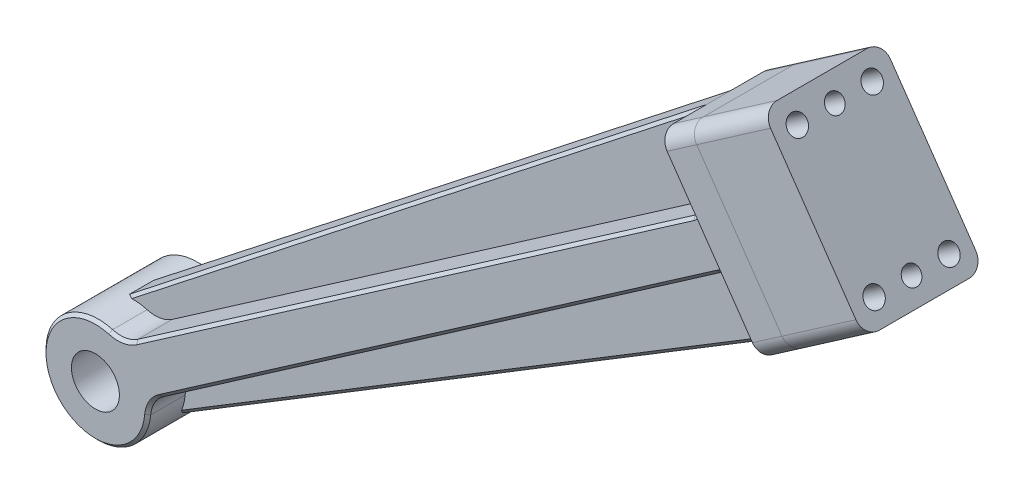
ISO-10303-21;
HEADER;
FILE_DESCRIPTION(('STEP AP214'),'2;1');
FILE_NAME('part.step','',(''),(''),'','','');
FILE_SCHEMA(('AUTOMOTIVE_DESIGN { 1 0 10303 214 1 1 1 1 }'));
ENDSEC;
DATA;
#1=APPLICATION_CONTEXT('core data for automotive mechanical design processes');
#2=APPLICATION_PROTOCOL_DEFINITION('international standard','automotive_design',2000,#1);
#3=PRODUCT_CONTEXT('',#1,'mechanical');
#4=PRODUCT('Part','Part','',(#3));
#5=PRODUCT_RELATED_PRODUCT_CATEGORY('part','',(#4));
#6=PRODUCT_DEFINITION_FORMATION('','',#4);
#7=PRODUCT_DEFINITION_CONTEXT('part definition',#1,'design');
#8=PRODUCT_DEFINITION('design','',#6,#7);
#9=PRODUCT_DEFINITION_SHAPE('','',#8);
#10=(LENGTH_UNIT() NAMED_UNIT(*) SI_UNIT(.MILLI.,.METRE.));
#11=(NAMED_UNIT(*) PLANE_ANGLE_UNIT() SI_UNIT($,.RADIAN.));
#12=(NAMED_UNIT(*) SI_UNIT($,.STERADIAN.) SOLID_ANGLE_UNIT());
#13=UNCERTAINTY_MEASURE_WITH_UNIT(LENGTH_MEASURE(1.E-05),#10,'distance_accuracy_value','');
#14=(GEOMETRIC_REPRESENTATION_CONTEXT(3) GLOBAL_UNCERTAINTY_ASSIGNED_CONTEXT((#13)) GLOBAL_UNIT_ASSIGNED_CONTEXT((#10,
#11,#12)) REPRESENTATION_CONTEXT('',''));
#15=CARTESIAN_POINT('',(0.,0.,0.));
#16=DIRECTION('',(0.,0.,1.));
#17=DIRECTION('',(1.,0.,0.));
#18=AXIS2_PLACEMENT_3D('',#15,#16,#17);
#19=CARTESIAN_POINT('',(456.798980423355,631.828314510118,37.5));
#20=DIRECTION('',(0.,0.,-1.));
#21=DIRECTION('',(0.569636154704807,-0.821896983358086,0.));
#22=AXIS2_PLACEMENT_3D('',#19,#20,#21);
#23=PLANE('',#22);
#24=CARTESIAN_POINT('',(249.237116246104,487.972400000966,37.5));
#25=DIRECTION('',(0.,0.,-1.));
#26=DIRECTION('',(0.569636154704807,-0.821896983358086,0.));
#27=AXIS2_PLACEMENT_3D('',#24,#25,#26);
#28=CIRCLE('',#27,8.);
#29=CARTESIAN_POINT('',(253.794205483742,481.397224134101,37.5));
#30=VERTEX_POINT('',#29);
#31=EDGE_CURVE('P0_E311',#30,#30,#28,.T.);
#32=ORIENTED_EDGE('',*,*,#31,.F.);
#33=EDGE_LOOP('',(#32));
#34=FACE_BOUND('',#33,.T.);
#35=DIRECTION('',(-0.569636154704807,0.821896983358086,0.));
#36=VECTOR('',#35,1.);
#37=CARTESIAN_POINT('',(439.709895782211,656.48522401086,37.5));
#38=LINE('',#37,#36);
#39=CARTESIAN_POINT('',(462.030162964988,624.280526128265,37.5));
#40=VERTEX_POINT('',#39);
#41=CARTESIAN_POINT('',(451.567797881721,639.37610289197,37.5));
#42=VERTEX_POINT('',#41);
#43=EDGE_CURVE('P0_E493',#40,#42,#38,.T.);
#44=ORIENTED_EDGE('',*,*,#43,.F.);
#45=CARTESIAN_POINT('',(459.809947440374,618.706421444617,37.5));
#46=DIRECTION('',(0.,0.,-1.));
#47=DIRECTION('',(0.569636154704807,-0.821896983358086,0.));
#48=AXIS2_PLACEMENT_3D('',#45,#46,#47);
#49=CIRCLE('',#48,6.);
#50=CARTESIAN_POINT('',(456.392130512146,623.637803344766,37.5));
#51=VERTEX_POINT('',#50);
#52=EDGE_CURVE('P0_E991',#40,#51,#49,.F.);
#53=ORIENTED_EDGE('',*,*,#52,.T.);
#54=DIRECTION('',(-0.821896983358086,-0.569636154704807,0.));
#55=VECTOR('',#54,1.);
#56=CARTESIAN_POINT('',(460.501615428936,626.48598411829,37.5));
#57=LINE('',#56,#55);
#58=CARTESIAN_POINT('',(270.374819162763,494.713877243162,37.5));
#59=VERTEX_POINT('',#58);
#60=EDGE_CURVE('P0_E987',#51,#59,#57,.T.);
#61=ORIENTED_EDGE('',*,*,#60,.T.);
#62=CARTESIAN_POINT('',(276.640816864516,485.673010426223,37.5));
#63=DIRECTION('',(0.,0.,-1.));
#64=DIRECTION('',(0.569636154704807,-0.821896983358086,0.));
#65=AXIS2_PLACEMENT_3D('',#62,#63,#64);
#66=CIRCLE('',#65,11.);
#67=CARTESIAN_POINT('',(265.679336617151,486.59276625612,37.5));
#68=VERTEX_POINT('',#67);
#69=EDGE_CURVE('P0_E984',#59,#68,#66,.F.);
#70=ORIENTED_EDGE('',*,*,#69,.T.);
#71=CARTESIAN_POINT('',(249.237116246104,487.972400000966,37.5));
#72=DIRECTION('',(0.,0.,-1.));
#73=DIRECTION('',(0.569636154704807,-0.821896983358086,0.));
#74=AXIS2_PLACEMENT_3D('',#71,#72,#73);
#75=CIRCLE('',#74,16.5);
#76=CARTESIAN_POINT('',(253.71697736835,503.85260290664,37.5));
#77=VERTEX_POINT('',#76);
#78=EDGE_CURVE('P0_E981',#68,#77,#75,.T.);
#79=ORIENTED_EDGE('',*,*,#78,.T.);
#80=CARTESIAN_POINT('',(256.703551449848,514.439404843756,37.5));
#81=DIRECTION('',(0.,0.,-1.));
#82=DIRECTION('',(0.569636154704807,-0.821896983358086,0.));
#83=AXIS2_PLACEMENT_3D('',#80,#81,#82);
#84=CIRCLE('',#83,11.);
#85=CARTESIAN_POINT('',(262.969549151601,505.398538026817,37.5));
#86=VERTEX_POINT('',#85);
#87=EDGE_CURVE('P0_E978',#77,#86,#84,.F.);
#88=ORIENTED_EDGE('',*,*,#87,.T.);
#89=DIRECTION('',(0.821896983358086,0.569636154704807,0.));
#90=VECTOR('',#89,1.);
#91=CARTESIAN_POINT('',(453.096345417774,637.170644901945,37.5));
#92=LINE('',#91,#90);
#93=CARTESIAN_POINT('',(448.986860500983,634.322464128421,37.5));
#94=VERTEX_POINT('',#93);
#95=EDGE_CURVE('P0_E970',#86,#94,#92,.T.);
#96=ORIENTED_EDGE('',*,*,#95,.T.);
#97=CARTESIAN_POINT('',(445.569043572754,639.25384602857,37.5));
#98=DIRECTION('',(0.,0.,-1.));
#99=DIRECTION('',(0.569636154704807,-0.821896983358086,0.));
#100=AXIS2_PLACEMENT_3D('',#97,#98,#99);
#101=CIRCLE('',#100,6.);
#102=EDGE_CURVE('P0_E975',#94,#42,#101,.F.);
#103=ORIENTED_EDGE('',*,*,#102,.T.);
#104=EDGE_LOOP('',(#44,#53,#61,#70,#79,#88,#96,#103));
#105=FACE_BOUND('',#104,.T.);
#106=ADVANCED_FACE('P0_F16',(#34,#105),#23,.T.);
#107=CARTESIAN_POINT('',(439.709895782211,656.48522401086,72.5));
#108=DIRECTION('',(0.617365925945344,-0.786676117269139,0.));
#109=DIRECTION('',(0.786676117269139,0.617365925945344,0.));
#110=AXIS2_PLACEMENT_3D('',#107,#108,#109);
#111=PLANE('',#110);
#112=DIRECTION('',(0.,0.,1.));
#113=VECTOR('',#112,1.);
#114=CARTESIAN_POINT('',(247.118355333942,505.3436651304,37.5));
#115=LINE('',#114,#113);
#116=CARTESIAN_POINT('',(247.118355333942,505.3436651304,51.));
#117=VERTEX_POINT('',#116);
#118=CARTESIAN_POINT('',(247.118355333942,505.3436651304,59.));
#119=VERTEX_POINT('',#118);
#120=EDGE_CURVE('P0_E349',#117,#119,#115,.T.);
#121=ORIENTED_EDGE('',*,*,#120,.T.);
#122=DIRECTION('',(0.786676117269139,0.617365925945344,0.));
#123=VECTOR('',#122,1.);
#124=CARTESIAN_POINT('',(439.709895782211,656.48522401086,59.));
#125=LINE('',#124,#123);
#126=CARTESIAN_POINT('',(439.709895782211,656.48522401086,59.));
#127=VERTEX_POINT('',#126);
#128=EDGE_CURVE('P0_E965',#119,#127,#125,.T.);
#129=ORIENTED_EDGE('',*,*,#128,.T.);
#130=DIRECTION('',(0.,0.,-1.));
#131=VECTOR('',#130,1.);
#132=CARTESIAN_POINT('',(439.709895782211,656.48522401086,72.5));
#133=LINE('',#132,#131);
#134=CARTESIAN_POINT('',(439.709895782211,656.48522401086,51.));
#135=VERTEX_POINT('',#134);
#136=EDGE_CURVE('P0_E531',#127,#135,#133,.T.);
#137=ORIENTED_EDGE('',*,*,#136,.T.);
#138=DIRECTION('',(-0.786676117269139,-0.617365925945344,0.));
#139=VECTOR('',#138,1.);
#140=CARTESIAN_POINT('',(247.118355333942,505.3436651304,51.));
#141=LINE('',#140,#139);
#142=EDGE_CURVE('P0_E530',#135,#117,#141,.T.);
#143=ORIENTED_EDGE('',*,*,#142,.T.);
#144=EDGE_LOOP('',(#121,#129,#137,#143));
#145=FACE_BOUND('',#144,.T.);
#146=ADVANCED_FACE('P0_F798',(#145),#111,.F.);
#147=CARTESIAN_POINT('',(473.888065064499,607.171405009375,72.5));
#148=DIRECTION('',(-0.519902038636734,0.854225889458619,0.));
#149=DIRECTION('',(-0.854225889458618,-0.519902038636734,0.));
#150=AXIS2_PLACEMENT_3D('',#147,#148,#149);
#151=PLANE('',#150);
#152=DIRECTION('',(0.,0.,1.));
#153=VECTOR('',#152,1.);
#154=CARTESIAN_POINT('',(264.75920462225,479.890644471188,37.5));
#155=LINE('',#154,#153);
#156=CARTESIAN_POINT('',(264.75920462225,479.890644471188,59.));
#157=VERTEX_POINT('',#156);
#158=CARTESIAN_POINT('',(264.75920462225,479.890644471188,51.));
#159=VERTEX_POINT('',#158);
#160=EDGE_CURVE('P0_E361',#157,#159,#155,.F.);
#161=ORIENTED_EDGE('',*,*,#160,.T.);
#162=DIRECTION('',(0.854225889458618,0.519902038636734,0.));
#163=VECTOR('',#162,1.);
#164=CARTESIAN_POINT('',(473.888065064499,607.171405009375,51.));
#165=LINE('',#164,#163);
#166=CARTESIAN_POINT('',(473.888065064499,607.171405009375,51.));
#167=VERTEX_POINT('',#166);
#168=EDGE_CURVE('P0_E918',#159,#167,#165,.T.);
#169=ORIENTED_EDGE('',*,*,#168,.T.);
#170=DIRECTION('',(0.,0.,-1.));
#171=VECTOR('',#170,1.);
#172=CARTESIAN_POINT('',(473.888065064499,607.171405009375,72.5));
#173=LINE('',#172,#171);
#174=CARTESIAN_POINT('',(473.888065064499,607.171405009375,59.));
#175=VERTEX_POINT('',#174);
#176=EDGE_CURVE('P0_E428',#175,#167,#173,.T.);
#177=ORIENTED_EDGE('',*,*,#176,.F.);
#178=DIRECTION('',(-0.854225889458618,-0.519902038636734,0.));
#179=VECTOR('',#178,1.);
#180=CARTESIAN_POINT('',(264.75920462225,479.890644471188,59.));
#181=LINE('',#180,#179);
#182=EDGE_CURVE('P0_E427',#175,#157,#181,.T.);
#183=ORIENTED_EDGE('',*,*,#182,.T.);
#184=EDGE_LOOP('',(#161,#169,#177,#183));
#185=FACE_BOUND('',#184,.T.);
#186=ADVANCED_FACE('P0_F804',(#185),#151,.F.);
#187=CARTESIAN_POINT('',(456.798980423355,631.828314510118,72.5));
#188=DIRECTION('',(0.,0.,-1.));
#189=DIRECTION('',(0.569636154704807,-0.821896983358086,0.));
#190=AXIS2_PLACEMENT_3D('',#187,#188,#189);
#191=PLANE('',#190);
#192=CARTESIAN_POINT('',(249.237116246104,487.972400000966,72.5));
#193=DIRECTION('',(0.,0.,1.));
#194=DIRECTION('',(-0.569636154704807,0.821896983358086,0.));
#195=AXIS2_PLACEMENT_3D('',#192,#193,#194);
#196=CIRCLE('',#195,8.);
#197=CARTESIAN_POINT('',(244.680027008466,494.547575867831,72.5));
#198=VERTEX_POINT('',#197);
#199=EDGE_CURVE('P0_E307',#198,#198,#196,.T.);
#200=ORIENTED_EDGE('',*,*,#199,.F.);
#201=EDGE_LOOP('',(#200));
#202=FACE_BOUND('',#201,.T.);
#203=DIRECTION('',(0.821896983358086,0.569636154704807,0.));
#204=VECTOR('',#203,1.);
#205=CARTESIAN_POINT('',(460.501615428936,626.48598411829,72.5));
#206=LINE('',#205,#204);
#207=CARTESIAN_POINT('',(270.374819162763,494.713877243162,72.5));
#208=VERTEX_POINT('',#207);
#209=CARTESIAN_POINT('',(456.392130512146,623.637803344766,72.5));
#210=VERTEX_POINT('',#209);
#211=EDGE_CURVE('P0_E508',#208,#210,#206,.T.);
#212=ORIENTED_EDGE('',*,*,#211,.T.);
#213=CARTESIAN_POINT('',(459.809947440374,618.706421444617,72.5));
#214=DIRECTION('',(0.,0.,-1.));
#215=DIRECTION('',(0.569636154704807,-0.821896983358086,0.));
#216=AXIS2_PLACEMENT_3D('',#213,#214,#215);
#217=CIRCLE('',#216,6.);
#218=CARTESIAN_POINT('',(462.030162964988,624.280526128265,72.5));
#219=VERTEX_POINT('',#218);
#220=EDGE_CURVE('P0_E502',#210,#219,#217,.T.);
#221=ORIENTED_EDGE('',*,*,#220,.T.);
#222=DIRECTION('',(-0.569636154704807,0.821896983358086,0.));
#223=VECTOR('',#222,1.);
#224=CARTESIAN_POINT('',(439.709895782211,656.48522401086,72.5));
#225=LINE('',#224,#223);
#226=CARTESIAN_POINT('',(451.567797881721,639.37610289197,72.5));
#227=VERTEX_POINT('',#226);
#228=EDGE_CURVE('P0_E535',#219,#227,#225,.T.);
#229=ORIENTED_EDGE('',*,*,#228,.T.);
#230=CARTESIAN_POINT('',(445.569043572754,639.25384602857,72.5));
#231=DIRECTION('',(0.,0.,-1.));
#232=DIRECTION('',(0.569636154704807,-0.821896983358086,0.));
#233=AXIS2_PLACEMENT_3D('',#230,#231,#232);
#234=CIRCLE('',#233,6.);
#235=CARTESIAN_POINT('',(448.986860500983,634.322464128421,72.5));
#236=VERTEX_POINT('',#235);
#237=EDGE_CURVE('P0_E901',#227,#236,#234,.T.);
#238=ORIENTED_EDGE('',*,*,#237,.T.);
#239=DIRECTION('',(-0.821896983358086,-0.569636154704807,0.));
#240=VECTOR('',#239,1.);
#241=CARTESIAN_POINT('',(453.096345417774,637.170644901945,72.5));
#242=LINE('',#241,#240);
#243=CARTESIAN_POINT('',(262.969549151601,505.398538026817,72.5));
#244=VERTEX_POINT('',#243);
#245=EDGE_CURVE('P0_E888',#236,#244,#242,.T.);
#246=ORIENTED_EDGE('',*,*,#245,.T.);
#247=CARTESIAN_POINT('',(256.703551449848,514.439404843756,72.5));
#248=DIRECTION('',(0.,0.,-1.));
#249=DIRECTION('',(0.569636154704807,-0.821896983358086,0.));
#250=AXIS2_PLACEMENT_3D('',#247,#248,#249);
#251=CIRCLE('',#250,11.);
#252=CARTESIAN_POINT('',(253.71697736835,503.85260290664,72.5));
#253=VERTEX_POINT('',#252);
#254=EDGE_CURVE('P0_E885',#244,#253,#251,.T.);
#255=ORIENTED_EDGE('',*,*,#254,.T.);
#256=CARTESIAN_POINT('',(249.237116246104,487.972400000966,72.5));
#257=DIRECTION('',(0.,0.,-1.));
#258=DIRECTION('',(0.569636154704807,-0.821896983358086,0.));
#259=AXIS2_PLACEMENT_3D('',#256,#257,#258);
#260=CIRCLE('',#259,16.5);
#261=CARTESIAN_POINT('',(265.679336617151,486.59276625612,72.5));
#262=VERTEX_POINT('',#261);
#263=EDGE_CURVE('P0_E1034',#253,#262,#260,.F.);
#264=ORIENTED_EDGE('',*,*,#263,.T.);
#265=CARTESIAN_POINT('',(276.640816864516,485.673010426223,72.5));
#266=DIRECTION('',(0.,0.,-1.));
#267=DIRECTION('',(0.569636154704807,-0.821896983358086,0.));
#268=AXIS2_PLACEMENT_3D('',#265,#266,#267);
#269=CIRCLE('',#268,11.);
#270=EDGE_CURVE('P0_E659',#262,#208,#269,.T.);
#271=ORIENTED_EDGE('',*,*,#270,.T.);
#272=EDGE_LOOP('',(#212,#221,#229,#238,#246,#255,#264,#271));
#273=FACE_BOUND('',#272,.T.);
#274=ADVANCED_FACE('P0_F810',(#202,#273),#191,.F.);
#275=CARTESIAN_POINT('',(461.071251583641,625.664087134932,60.));
#276=DIRECTION('',(-0.569636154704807,0.821896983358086,0.));
#277=DIRECTION('',(0.,0.,-1.));
#278=AXIS2_PLACEMENT_3D('',#275,#276,#277);
#279=PLANE('',#278);
#280=DIRECTION('',(0.,0.,1.));
#281=VECTOR('',#280,1.);
#282=CARTESIAN_POINT('',(456.96176666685,622.815906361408,72.5));
#283=LINE('',#282,#281);
#284=CARTESIAN_POINT('',(456.96176666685,622.815906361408,60.));
#285=VERTEX_POINT('',#284);
#286=CARTESIAN_POINT('',(456.96176666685,622.815906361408,71.5));
#287=VERTEX_POINT('',#286);
#288=EDGE_CURVE('P0_E466',#285,#287,#283,.T.);
#289=ORIENTED_EDGE('',*,*,#288,.T.);
#290=DIRECTION('',(-0.821896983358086,-0.569636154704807,0.));
#291=VECTOR('',#290,1.);
#292=CARTESIAN_POINT('',(461.071251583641,625.664087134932,71.5));
#293=LINE('',#292,#291);
#294=CARTESIAN_POINT('',(270.944455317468,493.891980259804,71.5));
#295=VERTEX_POINT('',#294);
#296=EDGE_CURVE('P0_E1024',#287,#295,#293,.T.);
#297=ORIENTED_EDGE('',*,*,#296,.T.);
#298=DIRECTION('',(0.,0.,1.));
#299=VECTOR('',#298,1.);
#300=CARTESIAN_POINT('',(270.944455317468,493.891980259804,60.));
#301=LINE('',#300,#299);
#302=CARTESIAN_POINT('',(270.944455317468,493.891980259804,60.));
#303=VERTEX_POINT('',#302);
#304=EDGE_CURVE('P0_E491',#295,#303,#301,.F.);
#305=ORIENTED_EDGE('',*,*,#304,.T.);
#306=DIRECTION('',(-0.821896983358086,-0.569636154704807,0.));
#307=VECTOR('',#306,1.);
#308=CARTESIAN_POINT('',(461.071251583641,625.664087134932,60.));
#309=LINE('',#308,#307);
#310=EDGE_CURVE('P0_E482',#285,#303,#309,.T.);
#311=ORIENTED_EDGE('',*,*,#310,.F.);
#312=EDGE_LOOP('',(#289,#297,#305,#311));
#313=FACE_BOUND('',#312,.T.);
#314=ADVANCED_FACE('P0_F489',(#313),#279,.F.);
#315=CARTESIAN_POINT('',(456.798980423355,631.828314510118,60.));
#316=DIRECTION('',(0.,0.,1.));
#317=DIRECTION('',(-0.569636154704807,0.821896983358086,0.));
#318=AXIS2_PLACEMENT_3D('',#315,#316,#317);
#319=PLANE('',#318);
#320=CARTESIAN_POINT('',(249.237116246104,487.972400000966,60.));
#321=DIRECTION('',(0.,0.,1.));
#322=DIRECTION('',(-0.569636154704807,0.821896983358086,0.));
#323=AXIS2_PLACEMENT_3D('',#320,#321,#322);
#324=CIRCLE('',#323,17.5);
#325=CARTESIAN_POINT('',(265.501375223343,481.512997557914,60.));
#326=VERTEX_POINT('',#325);
#327=CARTESIAN_POINT('',(266.675834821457,486.509152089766,60.));
#328=VERTEX_POINT('',#327);
#329=EDGE_CURVE('P0_E365',#326,#328,#324,.T.);
#330=ORIENTED_EDGE('',*,*,#329,.F.);
#331=DIRECTION('',(0.854225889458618,0.519902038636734,0.));
#332=VECTOR('',#331,1.);
#333=CARTESIAN_POINT('',(473.368163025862,608.025630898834,60.));
#334=LINE('',#333,#332);
#335=CARTESIAN_POINT('',(473.317424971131,607.994750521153,60.));
#336=VERTEX_POINT('',#335);
#337=EDGE_CURVE('P0_E922',#326,#336,#334,.T.);
#338=ORIENTED_EDGE('',*,*,#337,.T.);
#339=DIRECTION('',(-0.569636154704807,0.821896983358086,0.));
#340=VECTOR('',#339,1.);
#341=CARTESIAN_POINT('',(473.888065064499,607.171405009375,60.));
#342=LINE('',#341,#340);
#343=CARTESIAN_POINT('',(463.919432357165,621.554602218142,60.));
#344=VERTEX_POINT('',#343);
#345=EDGE_CURVE('P0_E486',#336,#344,#342,.T.);
#346=ORIENTED_EDGE('',*,*,#345,.T.);
#347=CARTESIAN_POINT('',(459.809947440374,618.706421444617,60.));
#348=DIRECTION('',(0.,0.,1.));
#349=DIRECTION('',(-0.569636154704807,0.821896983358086,0.));
#350=AXIS2_PLACEMENT_3D('',#347,#348,#349);
#351=CIRCLE('',#350,5.);
#352=EDGE_CURVE('P0_E405',#344,#285,#351,.T.);
#353=ORIENTED_EDGE('',*,*,#352,.T.);
#354=ORIENTED_EDGE('',*,*,#310,.T.);
#355=CARTESIAN_POINT('',(276.640816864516,485.673010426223,60.));
#356=DIRECTION('',(0.,0.,1.));
#357=DIRECTION('',(-0.569636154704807,0.821896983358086,0.));
#358=AXIS2_PLACEMENT_3D('',#355,#356,#357);
#359=CIRCLE('',#358,10.);
#360=EDGE_CURVE('P0_E452',#303,#328,#359,.T.);
#361=ORIENTED_EDGE('',*,*,#360,.T.);
#362=EDGE_LOOP('',(#330,#338,#346,#353,#354,#361));
#363=FACE_BOUND('',#362,.T.);
#364=ADVANCED_FACE('P0_F480',(#363),#319,.T.);
#365=CARTESIAN_POINT('',(452.526709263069,637.992541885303,60.));
#366=DIRECTION('',(0.569636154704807,-0.821896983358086,0.));
#367=DIRECTION('',(0.,0.,1.));
#368=AXIS2_PLACEMENT_3D('',#365,#366,#367);
#369=PLANE('',#368);
#370=DIRECTION('',(0.,0.,1.));
#371=VECTOR('',#370,1.);
#372=CARTESIAN_POINT('',(262.399912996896,506.220435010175,60.));
#373=LINE('',#372,#371);
#374=CARTESIAN_POINT('',(262.399912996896,506.220435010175,60.));
#375=VERTEX_POINT('',#374);
#376=CARTESIAN_POINT('',(262.399912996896,506.220435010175,71.5));
#377=VERTEX_POINT('',#376);
#378=EDGE_CURVE('P0_E629',#375,#377,#373,.T.);
#379=ORIENTED_EDGE('',*,*,#378,.T.);
#380=DIRECTION('',(0.821896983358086,0.569636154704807,0.));
#381=VECTOR('',#380,1.);
#382=CARTESIAN_POINT('',(452.526709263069,637.992541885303,71.5));
#383=LINE('',#382,#381);
#384=CARTESIAN_POINT('',(448.417224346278,635.144361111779,71.5));
#385=VERTEX_POINT('',#384);
#386=EDGE_CURVE('P0_E523',#377,#385,#383,.T.);
#387=ORIENTED_EDGE('',*,*,#386,.T.);
#388=DIRECTION('',(0.,0.,1.));
#389=VECTOR('',#388,1.);
#390=CARTESIAN_POINT('',(448.417224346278,635.144361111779,60.));
#391=LINE('',#390,#389);
#392=CARTESIAN_POINT('',(448.417224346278,635.144361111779,60.));
#393=VERTEX_POINT('',#392);
#394=EDGE_CURVE('P0_E461',#385,#393,#391,.F.);
#395=ORIENTED_EDGE('',*,*,#394,.T.);
#396=DIRECTION('',(0.821896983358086,0.569636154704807,0.));
#397=VECTOR('',#396,1.);
#398=CARTESIAN_POINT('',(452.526709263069,637.992541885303,60.));
#399=LINE('',#398,#397);
#400=EDGE_CURVE('P0_E450',#375,#393,#399,.T.);
#401=ORIENTED_EDGE('',*,*,#400,.F.);
#402=EDGE_LOOP('',(#379,#387,#395,#401));
#403=FACE_BOUND('',#402,.T.);
#404=ADVANCED_FACE('P0_F892',(#403),#369,.F.);
#405=CARTESIAN_POINT('',(456.798980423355,631.828314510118,60.));
#406=DIRECTION('',(0.,0.,1.));
#407=DIRECTION('',(-0.569636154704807,0.821896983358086,0.));
#408=AXIS2_PLACEMENT_3D('',#405,#406,#407);
#409=PLANE('',#408);
#410=DIRECTION('',(-0.569636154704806,0.821896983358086,0.));
#411=VECTOR('',#410,1.);
#412=CARTESIAN_POINT('',(452.526709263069,637.992541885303,60.));
#413=LINE('',#412,#411);
#414=CARTESIAN_POINT('',(449.678528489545,642.102026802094,60.));
#415=VERTEX_POINT('',#414);
#416=CARTESIAN_POINT('',(440.280535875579,655.661878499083,60.));
#417=VERTEX_POINT('',#416);
#418=EDGE_CURVE('P0_E445',#415,#417,#413,.T.);
#419=ORIENTED_EDGE('',*,*,#418,.T.);
#420=DIRECTION('',(-0.786676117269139,-0.617365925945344,0.));
#421=VECTOR('',#420,1.);
#422=CARTESIAN_POINT('',(247.735721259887,504.556989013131,60.));
#423=LINE('',#422,#421);
#424=CARTESIAN_POINT('',(248.897992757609,505.4691138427,60.));
#425=VERTEX_POINT('',#424);
#426=EDGE_CURVE('P0_E526',#417,#425,#423,.T.);
#427=ORIENTED_EDGE('',*,*,#426,.T.);
#428=CARTESIAN_POINT('',(249.237116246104,487.972400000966,60.));
#429=DIRECTION('',(0.,0.,1.));
#430=DIRECTION('',(-0.569636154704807,0.821896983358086,0.));
#431=AXIS2_PLACEMENT_3D('',#428,#429,#430);
#432=CIRCLE('',#431,17.5);
#433=CARTESIAN_POINT('',(253.988484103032,504.815039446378,60.));
#434=VERTEX_POINT('',#433);
#435=EDGE_CURVE('P0_E353',#434,#425,#432,.T.);
#436=ORIENTED_EDGE('',*,*,#435,.F.);
#437=CARTESIAN_POINT('',(256.703551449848,514.439404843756,60.));
#438=DIRECTION('',(0.,0.,1.));
#439=DIRECTION('',(-0.569636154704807,0.821896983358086,0.));
#440=AXIS2_PLACEMENT_3D('',#437,#438,#439);
#441=CIRCLE('',#440,10.);
#442=EDGE_CURVE('P0_E633',#434,#375,#441,.T.);
#443=ORIENTED_EDGE('',*,*,#442,.T.);
#444=ORIENTED_EDGE('',*,*,#400,.T.);
#445=CARTESIAN_POINT('',(445.569043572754,639.25384602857,60.));
#446=DIRECTION('',(0.,0.,1.));
#447=DIRECTION('',(-0.569636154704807,0.821896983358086,0.));
#448=AXIS2_PLACEMENT_3D('',#445,#446,#447);
#449=CIRCLE('',#448,5.);
#450=EDGE_CURVE('P0_E464',#393,#415,#449,.T.);
#451=ORIENTED_EDGE('',*,*,#450,.T.);
#452=EDGE_LOOP('',(#419,#427,#436,#443,#444,#451));
#453=FACE_BOUND('',#452,.T.);
#454=ADVANCED_FACE('P0_F1106',(#453),#409,.T.);
#455=CARTESIAN_POINT('',(461.071251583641,625.664087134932,50.));
#456=DIRECTION('',(0.569636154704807,-0.821896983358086,0.));
#457=DIRECTION('',(0.,0.,1.));
#458=AXIS2_PLACEMENT_3D('',#455,#456,#457);
#459=PLANE('',#458);
#460=DIRECTION('',(0.,0.,-1.));
#461=VECTOR('',#460,1.);
#462=CARTESIAN_POINT('',(270.944455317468,493.891980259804,37.5));
#463=LINE('',#462,#461);
#464=CARTESIAN_POINT('',(270.944455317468,493.891980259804,50.));
#465=VERTEX_POINT('',#464);
#466=CARTESIAN_POINT('',(270.944455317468,493.891980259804,38.5));
#467=VERTEX_POINT('',#466);
#468=EDGE_CURVE('P0_E618',#465,#467,#463,.T.);
#469=ORIENTED_EDGE('',*,*,#468,.T.);
#470=DIRECTION('',(0.821896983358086,0.569636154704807,0.));
#471=VECTOR('',#470,1.);
#472=CARTESIAN_POINT('',(461.071251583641,625.664087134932,38.5));
#473=LINE('',#472,#471);
#474=CARTESIAN_POINT('',(456.96176666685,622.815906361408,38.5));
#475=VERTEX_POINT('',#474);
#476=EDGE_CURVE('P0_E994',#467,#475,#473,.T.);
#477=ORIENTED_EDGE('',*,*,#476,.T.);
#478=DIRECTION('',(0.,0.,-1.));
#479=VECTOR('',#478,1.);
#480=CARTESIAN_POINT('',(456.96176666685,622.815906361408,50.));
#481=LINE('',#480,#479);
#482=CARTESIAN_POINT('',(456.96176666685,622.815906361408,50.));
#483=VERTEX_POINT('',#482);
#484=EDGE_CURVE('P0_E414',#475,#483,#481,.F.);
#485=ORIENTED_EDGE('',*,*,#484,.T.);
#486=DIRECTION('',(-0.821896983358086,-0.569636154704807,0.));
#487=VECTOR('',#486,1.);
#488=CARTESIAN_POINT('',(461.071251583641,625.664087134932,50.));
#489=LINE('',#488,#487);
#490=EDGE_CURVE('P0_E917',#483,#465,#489,.T.);
#491=ORIENTED_EDGE('',*,*,#490,.T.);
#492=EDGE_LOOP('',(#469,#477,#485,#491));
#493=FACE_BOUND('',#492,.T.);
#494=ADVANCED_FACE('P0_F1102',(#493),#459,.T.);
#495=CARTESIAN_POINT('',(456.798980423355,631.828314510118,50.));
#496=DIRECTION('',(0.,0.,-1.));
#497=DIRECTION('',(-0.569636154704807,0.821896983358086,0.));
#498=AXIS2_PLACEMENT_3D('',#495,#496,#497);
#499=PLANE('',#498);
#500=DIRECTION('',(-0.569636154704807,0.821896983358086,0.));
#501=VECTOR('',#500,1.);
#502=CARTESIAN_POINT('',(473.888065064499,607.171405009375,50.));
#503=LINE('',#502,#501);
#504=CARTESIAN_POINT('',(473.317424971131,607.994750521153,50.));
#505=VERTEX_POINT('',#504);
#506=CARTESIAN_POINT('',(463.919432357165,621.554602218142,50.));
#507=VERTEX_POINT('',#506);
#508=EDGE_CURVE('P0_E451',#505,#507,#503,.T.);
#509=ORIENTED_EDGE('',*,*,#508,.F.);
#510=DIRECTION('',(-0.854225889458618,-0.519902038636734,0.));
#511=VECTOR('',#510,1.);
#512=CARTESIAN_POINT('',(264.239302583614,480.744870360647,50.));
#513=LINE('',#512,#511);
#514=CARTESIAN_POINT('',(265.501375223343,481.512997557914,50.));
#515=VERTEX_POINT('',#514);
#516=EDGE_CURVE('P0_E919',#505,#515,#513,.T.);
#517=ORIENTED_EDGE('',*,*,#516,.T.);
#518=CARTESIAN_POINT('',(249.237116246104,487.972400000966,50.));
#519=DIRECTION('',(0.,0.,-1.));
#520=DIRECTION('',(0.569636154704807,-0.821896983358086,0.));
#521=AXIS2_PLACEMENT_3D('',#518,#519,#520);
#522=CIRCLE('',#521,17.5);
#523=CARTESIAN_POINT('',(266.675834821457,486.509152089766,50.));
#524=VERTEX_POINT('',#523);
#525=EDGE_CURVE('P0_E357',#524,#515,#522,.T.);
#526=ORIENTED_EDGE('',*,*,#525,.F.);
#527=CARTESIAN_POINT('',(276.640816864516,485.673010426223,50.));
#528=DIRECTION('',(0.,0.,-1.));
#529=DIRECTION('',(0.569636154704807,-0.821896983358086,0.));
#530=AXIS2_PLACEMENT_3D('',#527,#528,#529);
#531=CIRCLE('',#530,10.);
#532=EDGE_CURVE('P0_E614',#524,#465,#531,.T.);
#533=ORIENTED_EDGE('',*,*,#532,.T.);
#534=ORIENTED_EDGE('',*,*,#490,.F.);
#535=CARTESIAN_POINT('',(459.809947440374,618.706421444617,50.));
#536=DIRECTION('',(0.,0.,-1.));
#537=DIRECTION('',(0.569636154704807,-0.821896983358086,0.));
#538=AXIS2_PLACEMENT_3D('',#535,#536,#537);
#539=CIRCLE('',#538,5.);
#540=EDGE_CURVE('P0_E417',#483,#507,#539,.T.);
#541=ORIENTED_EDGE('',*,*,#540,.T.);
#542=EDGE_LOOP('',(#509,#517,#526,#533,#534,#541));
#543=FACE_BOUND('',#542,.T.);
#544=ADVANCED_FACE('P0_F1099',(#543),#499,.T.);
#545=CARTESIAN_POINT('',(452.526709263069,637.992541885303,50.));
#546=DIRECTION('',(-0.569636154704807,0.821896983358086,0.));
#547=DIRECTION('',(0.,0.,-1.));
#548=AXIS2_PLACEMENT_3D('',#545,#546,#547);
#549=PLANE('',#548);
#550=DIRECTION('',(0.,0.,-1.));
#551=VECTOR('',#550,1.);
#552=CARTESIAN_POINT('',(448.417224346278,635.144361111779,50.));
#553=LINE('',#552,#551);
#554=CARTESIAN_POINT('',(448.417224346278,635.144361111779,50.));
#555=VERTEX_POINT('',#554);
#556=CARTESIAN_POINT('',(448.417224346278,635.144361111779,38.5));
#557=VERTEX_POINT('',#556);
#558=EDGE_CURVE('P0_E421',#555,#557,#553,.T.);
#559=ORIENTED_EDGE('',*,*,#558,.T.);
#560=DIRECTION('',(-0.821896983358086,-0.569636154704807,0.));
#561=VECTOR('',#560,1.);
#562=CARTESIAN_POINT('',(452.526709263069,637.992541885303,38.5));
#563=LINE('',#562,#561);
#564=CARTESIAN_POINT('',(262.399912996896,506.220435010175,38.5));
#565=VERTEX_POINT('',#564);
#566=EDGE_CURVE('P0_E1008',#557,#565,#563,.T.);
#567=ORIENTED_EDGE('',*,*,#566,.T.);
#568=DIRECTION('',(0.,0.,-1.));
#569=VECTOR('',#568,1.);
#570=CARTESIAN_POINT('',(262.399912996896,506.220435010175,50.));
#571=LINE('',#570,#569);
#572=CARTESIAN_POINT('',(262.399912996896,506.220435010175,50.));
#573=VERTEX_POINT('',#572);
#574=EDGE_CURVE('P0_E622',#565,#573,#571,.F.);
#575=ORIENTED_EDGE('',*,*,#574,.T.);
#576=DIRECTION('',(0.821896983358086,0.569636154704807,0.));
#577=VECTOR('',#576,1.);
#578=CARTESIAN_POINT('',(452.526709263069,637.992541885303,50.));
#579=LINE('',#578,#577);
#580=EDGE_CURVE('P0_E398',#573,#555,#579,.T.);
#581=ORIENTED_EDGE('',*,*,#580,.T.);
#582=EDGE_LOOP('',(#559,#567,#575,#581));
#583=FACE_BOUND('',#582,.T.);
#584=ADVANCED_FACE('P0_F936',(#583),#549,.T.);
#585=CARTESIAN_POINT('',(456.798980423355,631.828314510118,50.));
#586=DIRECTION('',(0.,0.,-1.));
#587=DIRECTION('',(-0.569636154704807,0.821896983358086,0.));
#588=AXIS2_PLACEMENT_3D('',#585,#586,#587);
#589=PLANE('',#588);
#590=CARTESIAN_POINT('',(249.237116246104,487.972400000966,50.));
#591=DIRECTION('',(0.,0.,-1.));
#592=DIRECTION('',(0.569636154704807,-0.821896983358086,0.));
#593=AXIS2_PLACEMENT_3D('',#590,#591,#592);
#594=CIRCLE('',#593,17.5);
#595=CARTESIAN_POINT('',(248.897992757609,505.4691138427,50.));
#596=VERTEX_POINT('',#595);
#597=CARTESIAN_POINT('',(253.988484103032,504.815039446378,50.));
#598=VERTEX_POINT('',#597);
#599=EDGE_CURVE('P0_E539',#596,#598,#594,.T.);
#600=ORIENTED_EDGE('',*,*,#599,.F.);
#601=DIRECTION('',(0.786676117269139,0.617365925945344,0.));
#602=VECTOR('',#601,1.);
#603=CARTESIAN_POINT('',(440.327261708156,655.698547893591,50.));
#604=LINE('',#603,#602);
#605=CARTESIAN_POINT('',(440.280535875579,655.661878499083,50.));
#606=VERTEX_POINT('',#605);
#607=EDGE_CURVE('P0_E945',#596,#606,#604,.T.);
#608=ORIENTED_EDGE('',*,*,#607,.T.);
#609=DIRECTION('',(-0.569636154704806,0.821896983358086,0.));
#610=VECTOR('',#609,1.);
#611=CARTESIAN_POINT('',(452.526709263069,637.992541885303,50.));
#612=LINE('',#611,#610);
#613=CARTESIAN_POINT('',(449.678528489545,642.102026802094,50.));
#614=VERTEX_POINT('',#613);
#615=EDGE_CURVE('P0_E386',#614,#606,#612,.T.);
#616=ORIENTED_EDGE('',*,*,#615,.F.);
#617=CARTESIAN_POINT('',(445.569043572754,639.25384602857,50.));
#618=DIRECTION('',(0.,0.,-1.));
#619=DIRECTION('',(0.569636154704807,-0.821896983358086,0.));
#620=AXIS2_PLACEMENT_3D('',#617,#618,#619);
#621=CIRCLE('',#620,5.);
#622=EDGE_CURVE('P0_E424',#614,#555,#621,.T.);
#623=ORIENTED_EDGE('',*,*,#622,.T.);
#624=ORIENTED_EDGE('',*,*,#580,.F.);
#625=CARTESIAN_POINT('',(256.703551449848,514.439404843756,50.));
#626=DIRECTION('',(0.,0.,-1.));
#627=DIRECTION('',(0.569636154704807,-0.821896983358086,0.));
#628=AXIS2_PLACEMENT_3D('',#625,#626,#627);
#629=CIRCLE('',#628,10.);
#630=EDGE_CURVE('P0_E625',#573,#598,#629,.T.);
#631=ORIENTED_EDGE('',*,*,#630,.T.);
#632=EDGE_LOOP('',(#600,#608,#616,#623,#624,#631));
#633=FACE_BOUND('',#632,.T.);
#634=ADVANCED_FACE('P0_F943',(#633),#589,.T.);
#635=CARTESIAN_POINT('',(456.798980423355,631.828314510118,55.));
#636=DIRECTION('',(0.821896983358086,0.569636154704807,0.));
#637=DIRECTION('',(0.,0.,-1.));
#638=AXIS2_PLACEMENT_3D('',#635,#636,#637);
#639=PLANE('',#638);
#640=CARTESIAN_POINT('',(469.615793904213,613.335632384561,42.5));
#641=DIRECTION('',(-0.821896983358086,-0.569636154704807,0.));
#642=DIRECTION('',(0.,0.,1.));
#643=AXIS2_PLACEMENT_3D('',#640,#641,#642);
#644=CIRCLE('',#643,3.3);
#645=CARTESIAN_POINT('',(469.615793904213,613.335632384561,45.8));
#646=VERTEX_POINT('',#645);
#647=EDGE_CURVE('P0_E316',#646,#646,#644,.T.);
#648=ORIENTED_EDGE('',*,*,#647,.F.);
#649=EDGE_LOOP('',(#648));
#650=FACE_BOUND('',#649,.T.);
#651=CARTESIAN_POINT('',(443.982166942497,650.320996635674,42.5));
#652=DIRECTION('',(-0.821896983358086,-0.569636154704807,0.));
#653=DIRECTION('',(0.,0.,1.));
#654=AXIS2_PLACEMENT_3D('',#651,#652,#653);
#655=CIRCLE('',#654,3.3);
#656=CARTESIAN_POINT('',(443.982166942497,650.320996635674,45.8));
#657=VERTEX_POINT('',#656);
#658=EDGE_CURVE('P0_E333',#657,#657,#655,.T.);
#659=ORIENTED_EDGE('',*,*,#658,.F.);
#660=EDGE_LOOP('',(#659));
#661=FACE_BOUND('',#660,.T.);
#662=DIRECTION('',(0.,0.,1.));
#663=VECTOR('',#662,1.);
#664=CARTESIAN_POINT('',(473.888065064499,607.171405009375,75.));
#665=LINE('',#664,#663);
#666=CARTESIAN_POINT('',(473.888065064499,607.171405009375,40.));
#667=VERTEX_POINT('',#666);
#668=EDGE_CURVE('P0_E551',#667,#167,#665,.T.);
#669=ORIENTED_EDGE('',*,*,#668,.T.);
#670=DIRECTION('',(-0.403148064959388,0.581680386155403,-0.706483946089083));
#671=VECTOR('',#670,1.);
#672=CARTESIAN_POINT('',(466.467747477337,617.877777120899,37.9965015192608));
#673=LINE('',#672,#671);
#674=EDGE_CURVE('P0_E1011',#167,#505,#673,.T.);
#675=ORIENTED_EDGE('',*,*,#674,.T.);
#676=ORIENTED_EDGE('',*,*,#508,.T.);
#677=DIRECTION('',(0.,0.,-1.));
#678=VECTOR('',#677,1.);
#679=CARTESIAN_POINT('',(463.919432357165,621.554602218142,55.));
#680=LINE('',#679,#678);
#681=CARTESIAN_POINT('',(463.919432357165,621.554602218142,38.5));
#682=VERTEX_POINT('',#681);
#683=EDGE_CURVE('P0_E410',#507,#682,#680,.T.);
#684=ORIENTED_EDGE('',*,*,#683,.T.);
#685=CARTESIAN_POINT('',(463.919432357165,621.554602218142,38.5));
#686=CARTESIAN_POINT('',(463.87566477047,621.617752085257,38.5000061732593));
#687=CARTESIAN_POINT('',(463.831903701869,621.680892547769,38.4982280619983));
#688=CARTESIAN_POINT('',(463.74448041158,621.807030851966,38.4911613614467));
#689=CARTESIAN_POINT('',(463.70081817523,621.870028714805,38.4858733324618));
#690=CARTESIAN_POINT('',(463.570268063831,622.058392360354,38.4648596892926));
#691=CARTESIAN_POINT('',(463.48363473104,622.1833908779,38.4439840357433));
#692=CARTESIAN_POINT('',(463.313074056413,622.429483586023,38.3900379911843));
#693=CARTESIAN_POINT('',(463.229125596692,622.550608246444,38.3571680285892));
#694=CARTESIAN_POINT('',(463.062817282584,622.79056545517,38.2806577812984));
#695=CARTESIAN_POINT('',(462.980458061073,622.909397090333,38.2370132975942));
#696=CARTESIAN_POINT('',(462.824180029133,623.134882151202,38.1444828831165));
#697=CARTESIAN_POINT('',(462.750121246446,623.241737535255,38.0963161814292));
#698=CARTESIAN_POINT('',(462.603509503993,623.453275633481,37.9933945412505));
#699=CARTESIAN_POINT('',(462.530956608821,623.557958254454,37.9386393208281));
#700=CARTESIAN_POINT('',(462.386184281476,623.766842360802,37.8226900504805));
#701=CARTESIAN_POINT('',(462.313987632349,623.87101097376,37.7614090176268));
#702=CARTESIAN_POINT('',(462.171035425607,624.077268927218,37.6340700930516));
#703=CARTESIAN_POINT('',(462.100278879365,624.179359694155,37.568015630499));
#704=CARTESIAN_POINT('',(462.030162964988,624.280526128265,37.5));
#705=B_SPLINE_CURVE_WITH_KNOTS('',3,(#685,#686,#687,#688,#689,#690,#691,#692,#693,#694,#695,
#696,#697,#698,#699,#700,#701,#702,#703,#704),.UNSPECIFIED.,.F.,.F.,(4,2,2,2,2,2,2,2,2,4),(0.,
0.230460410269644,0.460884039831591,0.920776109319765,1.37331103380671,1.8260225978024,
2.2417593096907,2.65751381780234,3.07974200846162,3.50166983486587),.UNSPECIFIED.);
#706=EDGE_CURVE('P0_E27',#682,#40,#705,.T.);
#707=ORIENTED_EDGE('',*,*,#706,.T.);
#708=ORIENTED_EDGE('',*,*,#43,.T.);
#709=CARTESIAN_POINT('',(451.567797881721,639.37610289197,37.5));
#710=CARTESIAN_POINT('',(451.516226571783,639.450512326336,37.5500373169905));
#711=CARTESIAN_POINT('',(451.464311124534,639.525418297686,37.5989995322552));
#712=CARTESIAN_POINT('',(451.359763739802,639.67626402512,37.694424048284));
#713=CARTESIAN_POINT('',(451.307132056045,639.752203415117,37.7408872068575));
#714=CARTESIAN_POINT('',(451.200858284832,639.905540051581,37.8311944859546));
#715=CARTESIAN_POINT('',(451.147212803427,639.98294219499,37.8750263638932));
#716=CARTESIAN_POINT('',(451.039070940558,640.138974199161,37.9594746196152));
#717=CARTESIAN_POINT('',(450.984574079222,640.217604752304,38.0000890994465));
#718=CARTESIAN_POINT('',(450.822767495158,640.451066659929,38.1143320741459));
#719=CARTESIAN_POINT('',(450.714259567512,640.607626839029,38.1828516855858));
#720=CARTESIAN_POINT('',(450.494165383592,640.925188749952,38.3022505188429));
#721=CARTESIAN_POINT('',(450.38258214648,641.086186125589,38.3531464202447));
#722=CARTESIAN_POINT('',(450.22144045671,641.318688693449,38.4106544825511));
#723=CARTESIAN_POINT('',(450.172864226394,641.38877669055,38.4259547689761));
#724=CARTESIAN_POINT('',(450.075339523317,641.529489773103,38.4524153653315));
#725=CARTESIAN_POINT('',(450.02639103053,641.600114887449,38.4635754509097));
#726=CARTESIAN_POINT('',(449.927698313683,641.742513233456,38.4816495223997));
#727=CARTESIAN_POINT('',(449.877951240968,641.814290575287,38.4885157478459));
#728=CARTESIAN_POINT('',(449.778313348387,641.958052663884,38.4976988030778));
#729=CARTESIAN_POINT('',(449.728422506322,642.030037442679,38.5000148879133));
#730=CARTESIAN_POINT('',(449.678528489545,642.102026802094,38.5));
#731=B_SPLINE_CURVE_WITH_KNOTS('',3,(#709,#710,#711,#712,#713,#714,#715,#716,#717,#718,#719,
#720,#721,#722,#723,#724,#725,#726,#727,#728,#729,#730),.UNSPECIFIED.,.F.,.F.,(4,2,2,2,2,2,2,2,
2,2,4),(0.,0.310328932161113,0.620550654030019,0.932118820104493,1.24386943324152,
1.85049055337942,2.4565359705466,2.71636584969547,2.97620980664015,3.23889486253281,
3.50162292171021),.UNSPECIFIED.);
#732=CARTESIAN_POINT('',(449.678528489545,642.102026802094,38.5));
#733=VERTEX_POINT('',#732);
#734=EDGE_CURVE('P0_E11',#42,#733,#731,.T.);
#735=ORIENTED_EDGE('',*,*,#734,.T.);
#736=DIRECTION('',(0.,0.,-1.));
#737=VECTOR('',#736,1.);
#738=CARTESIAN_POINT('',(449.678528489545,642.102026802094,55.));
#739=LINE('',#738,#737);
#740=EDGE_CURVE('P0_E407',#733,#614,#739,.F.);
#741=ORIENTED_EDGE('',*,*,#740,.T.);
#742=ORIENTED_EDGE('',*,*,#615,.T.);
#743=DIRECTION('',(-0.403148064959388,0.581680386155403,0.706483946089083));
#744=VECTOR('',#743,1.);
#745=CARTESIAN_POINT('',(447.130213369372,645.778851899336,37.9965015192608));
#746=LINE('',#745,#744);
#747=EDGE_CURVE('P0_E948',#606,#135,#746,.T.);
#748=ORIENTED_EDGE('',*,*,#747,.T.);
#749=DIRECTION('',(0.,0.,-1.));
#750=VECTOR('',#749,1.);
#751=CARTESIAN_POINT('',(439.709895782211,656.48522401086,75.));
#752=LINE('',#751,#750);
#753=CARTESIAN_POINT('',(439.709895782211,656.48522401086,40.));
#754=VERTEX_POINT('',#753);
#755=EDGE_CURVE('P0_E368',#135,#754,#752,.T.);
#756=ORIENTED_EDGE('',*,*,#755,.T.);
#757=CARTESIAN_POINT('',(442.558076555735,652.37573909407,40.));
#758=DIRECTION('',(0.821896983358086,0.569636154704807,0.));
#759=DIRECTION('',(0.,0.,-1.));
#760=AXIS2_PLACEMENT_3D('',#757,#758,#759);
#761=CIRCLE('',#760,5.);
#762=CARTESIAN_POINT('',(442.558076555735,652.37573909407,35.));
#763=VERTEX_POINT('',#762);
#764=EDGE_CURVE('P0_E557',#754,#763,#761,.F.);
#765=ORIENTED_EDGE('',*,*,#764,.T.);
#766=DIRECTION('',(0.569636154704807,-0.821896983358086,0.));
#767=VECTOR('',#766,1.);
#768=CARTESIAN_POINT('',(473.888065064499,607.171405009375,35.));
#769=LINE('',#768,#767);
#770=CARTESIAN_POINT('',(471.039884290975,611.280889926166,35.));
#771=VERTEX_POINT('',#770);
#772=EDGE_CURVE('P0_E389',#763,#771,#769,.T.);
#773=ORIENTED_EDGE('',*,*,#772,.T.);
#774=CARTESIAN_POINT('',(471.039884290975,611.280889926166,40.));
#775=DIRECTION('',(0.821896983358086,0.569636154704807,0.));
#776=DIRECTION('',(0.,0.,-1.));
#777=AXIS2_PLACEMENT_3D('',#774,#775,#776);
#778=CIRCLE('',#777,5.);
#779=EDGE_CURVE('P0_E550',#771,#667,#778,.F.);
#780=ORIENTED_EDGE('',*,*,#779,.T.);
#781=EDGE_LOOP('',(#669,#675,#676,#684,#707,#708,#735,#741,#742,#748,#756,#765,#773,#780));
#782=FACE_BOUND('',#781,.T.);
#783=ADVANCED_FACE('P0_F727',(#650,#661,#782),#639,.F.);
#784=CARTESIAN_POINT('',(449.572659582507,663.320857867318,75.));
#785=DIRECTION('',(-0.569636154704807,0.821896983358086,0.));
#786=DIRECTION('',(0.,0.,-1.));
#787=AXIS2_PLACEMENT_3D('',#784,#785,#786);
#788=PLANE('',#787);
#789=DIRECTION('',(0.,0.,-1.));
#790=VECTOR('',#789,1.);
#791=CARTESIAN_POINT('',(449.572659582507,663.320857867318,75.));
#792=LINE('',#791,#790);
#793=CARTESIAN_POINT('',(449.572659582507,663.320857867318,70.));
#794=VERTEX_POINT('',#793);
#795=CARTESIAN_POINT('',(449.572659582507,663.320857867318,40.));
#796=VERTEX_POINT('',#795);
#797=EDGE_CURVE('P0_E369',#794,#796,#792,.T.);
#798=ORIENTED_EDGE('',*,*,#797,.T.);
#799=DIRECTION('',(-0.821896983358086,-0.569636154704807,0.));
#800=VECTOR('',#799,1.);
#801=CARTESIAN_POINT('',(449.572659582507,663.320857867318,40.));
#802=LINE('',#801,#800);
#803=EDGE_CURVE('P0_E546',#796,#754,#802,.T.);
#804=ORIENTED_EDGE('',*,*,#803,.T.);
#805=ORIENTED_EDGE('',*,*,#755,.F.);
#806=ORIENTED_EDGE('',*,*,#136,.F.);
#807=CARTESIAN_POINT('',(439.709895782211,656.48522401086,70.));
#808=VERTEX_POINT('',#807);
#809=EDGE_CURVE('P0_E434',#808,#127,#133,.T.);
#810=ORIENTED_EDGE('',*,*,#809,.F.);
#811=DIRECTION('',(-0.821896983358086,-0.569636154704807,0.));
#812=VECTOR('',#811,1.);
#813=CARTESIAN_POINT('',(449.572659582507,663.320857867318,70.));
#814=LINE('',#813,#812);
#815=EDGE_CURVE('P0_E543',#808,#794,#814,.F.);
#816=ORIENTED_EDGE('',*,*,#815,.T.);
#817=EDGE_LOOP('',(#798,#804,#805,#806,#810,#816));
#818=FACE_BOUND('',#817,.T.);
#819=ADVANCED_FACE('P0_F1058',(#818),#788,.T.);
#820=CARTESIAN_POINT('',(483.750828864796,614.007038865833,75.));
#821=DIRECTION('',(0.,0.,1.));
#822=DIRECTION('',(-0.569636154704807,0.821896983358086,0.));
#823=AXIS2_PLACEMENT_3D('',#820,#821,#822);
#824=PLANE('',#823);
#825=DIRECTION('',(-0.569636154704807,0.821896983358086,0.));
#826=VECTOR('',#825,1.);
#827=CARTESIAN_POINT('',(483.750828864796,614.007038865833,75.));
#828=LINE('',#827,#826);
#829=CARTESIAN_POINT('',(480.902648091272,618.116523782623,75.));
#830=VERTEX_POINT('',#829);
#831=CARTESIAN_POINT('',(452.420840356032,659.211372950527,75.));
#832=VERTEX_POINT('',#831);
#833=EDGE_CURVE('P0_E382',#830,#832,#828,.T.);
#834=ORIENTED_EDGE('',*,*,#833,.T.);
#835=DIRECTION('',(-0.821896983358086,-0.569636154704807,0.));
#836=VECTOR('',#835,1.);
#837=CARTESIAN_POINT('',(452.420840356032,659.211372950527,75.));
#838=LINE('',#837,#836);
#839=CARTESIAN_POINT('',(442.558076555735,652.37573909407,75.));
#840=VERTEX_POINT('',#839);
#841=EDGE_CURVE('P0_E582',#832,#840,#838,.T.);
#842=ORIENTED_EDGE('',*,*,#841,.T.);
#843=DIRECTION('',(-0.569636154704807,0.821896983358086,0.));
#844=VECTOR('',#843,1.);
#845=CARTESIAN_POINT('',(473.888065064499,607.171405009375,75.));
#846=LINE('',#845,#844);
#847=CARTESIAN_POINT('',(471.039884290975,611.280889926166,75.));
#848=VERTEX_POINT('',#847);
#849=EDGE_CURVE('P0_E374',#848,#840,#846,.T.);
#850=ORIENTED_EDGE('',*,*,#849,.F.);
#851=DIRECTION('',(-0.821896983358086,-0.569636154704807,0.));
#852=VECTOR('',#851,1.);
#853=CARTESIAN_POINT('',(480.902648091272,618.116523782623,75.));
#854=LINE('',#853,#852);
#855=EDGE_CURVE('P0_E579',#848,#830,#854,.F.);
#856=ORIENTED_EDGE('',*,*,#855,.T.);
#857=EDGE_LOOP('',(#834,#842,#850,#856));
#858=FACE_BOUND('',#857,.T.);
#859=ADVANCED_FACE('P0_F729',(#858),#824,.T.);
#860=CARTESIAN_POINT('',(483.750828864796,614.007038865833,75.));
#861=DIRECTION('',(0.569636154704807,-0.821896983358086,0.));
#862=DIRECTION('',(0.,0.,1.));
#863=AXIS2_PLACEMENT_3D('',#860,#861,#862);
#864=PLANE('',#863);
#865=DIRECTION('',(0.,0.,1.));
#866=VECTOR('',#865,1.);
#867=CARTESIAN_POINT('',(483.750828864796,614.007038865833,75.));
#868=LINE('',#867,#866);
#869=CARTESIAN_POINT('',(483.750828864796,614.007038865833,40.));
#870=VERTEX_POINT('',#869);
#871=CARTESIAN_POINT('',(483.750828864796,614.007038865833,70.));
#872=VERTEX_POINT('',#871);
#873=EDGE_CURVE('P0_E378',#870,#872,#868,.T.);
#874=ORIENTED_EDGE('',*,*,#873,.T.);
#875=DIRECTION('',(-0.821896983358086,-0.569636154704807,0.));
#876=VECTOR('',#875,1.);
#877=CARTESIAN_POINT('',(483.750828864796,614.007038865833,70.));
#878=LINE('',#877,#876);
#879=CARTESIAN_POINT('',(473.888065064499,607.171405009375,70.));
#880=VERTEX_POINT('',#879);
#881=EDGE_CURVE('P0_E596',#872,#880,#878,.T.);
#882=ORIENTED_EDGE('',*,*,#881,.T.);
#883=EDGE_CURVE('P0_E433',#880,#175,#173,.T.);
#884=ORIENTED_EDGE('',*,*,#883,.T.);
#885=ORIENTED_EDGE('',*,*,#176,.T.);
#886=ORIENTED_EDGE('',*,*,#668,.F.);
#887=DIRECTION('',(-0.821896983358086,-0.569636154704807,0.));
#888=VECTOR('',#887,1.);
#889=CARTESIAN_POINT('',(483.750828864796,614.007038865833,40.));
#890=LINE('',#889,#888);
#891=EDGE_CURVE('P0_E593',#667,#870,#890,.F.);
#892=ORIENTED_EDGE('',*,*,#891,.T.);
#893=EDGE_LOOP('',(#874,#882,#884,#885,#886,#892));
#894=FACE_BOUND('',#893,.T.);
#895=ADVANCED_FACE('P0_F1049',(#894),#864,.T.);
#896=CARTESIAN_POINT('',(483.750828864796,614.007038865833,35.));
#897=DIRECTION('',(0.,0.,-1.));
#898=DIRECTION('',(0.569636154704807,-0.821896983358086,0.));
#899=AXIS2_PLACEMENT_3D('',#896,#897,#898);
#900=PLANE('',#899);
#901=ORIENTED_EDGE('',*,*,#772,.F.);
#902=DIRECTION('',(-0.821896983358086,-0.569636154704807,0.));
#903=VECTOR('',#902,1.);
#904=CARTESIAN_POINT('',(452.420840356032,659.211372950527,35.));
#905=LINE('',#904,#903);
#906=CARTESIAN_POINT('',(452.420840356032,659.211372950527,35.));
#907=VERTEX_POINT('',#906);
#908=EDGE_CURVE('P0_E564',#763,#907,#905,.F.);
#909=ORIENTED_EDGE('',*,*,#908,.T.);
#910=DIRECTION('',(0.569636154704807,-0.821896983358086,0.));
#911=VECTOR('',#910,1.);
#912=CARTESIAN_POINT('',(483.750828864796,614.007038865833,35.));
#913=LINE('',#912,#911);
#914=CARTESIAN_POINT('',(480.902648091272,618.116523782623,35.));
#915=VERTEX_POINT('',#914);
#916=EDGE_CURVE('P0_E373',#907,#915,#913,.T.);
#917=ORIENTED_EDGE('',*,*,#916,.T.);
#918=DIRECTION('',(-0.821896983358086,-0.569636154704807,0.));
#919=VECTOR('',#918,1.);
#920=CARTESIAN_POINT('',(480.902648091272,618.116523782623,35.));
#921=LINE('',#920,#919);
#922=EDGE_CURVE('P0_E560',#915,#771,#921,.T.);
#923=ORIENTED_EDGE('',*,*,#922,.T.);
#924=EDGE_LOOP('',(#901,#909,#917,#923));
#925=FACE_BOUND('',#924,.T.);
#926=ADVANCED_FACE('P0_F1065',(#925),#900,.T.);
#927=CARTESIAN_POINT('',(466.661744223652,638.663948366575,55.));
#928=DIRECTION('',(0.821896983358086,0.569636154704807,0.));
#929=DIRECTION('',(0.,0.,-1.));
#930=AXIS2_PLACEMENT_3D('',#927,#928,#929);
#931=PLANE('',#930);
#932=CARTESIAN_POINT('',(479.47855770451,620.171266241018,55.));
#933=DIRECTION('',(0.821896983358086,0.569636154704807,0.));
#934=DIRECTION('',(0.,0.,-1.));
#935=AXIS2_PLACEMENT_3D('',#932,#933,#934);
#936=CIRCLE('',#935,3.);
#937=CARTESIAN_POINT('',(479.47855770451,620.171266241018,52.));
#938=VERTEX_POINT('',#937);
#939=EDGE_CURVE('P0_E293',#938,#938,#936,.T.);
#940=ORIENTED_EDGE('',*,*,#939,.F.);
#941=EDGE_LOOP('',(#940));
#942=FACE_BOUND('',#941,.T.);
#943=CARTESIAN_POINT('',(453.844930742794,657.156630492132,55.));
#944=DIRECTION('',(0.821896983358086,0.569636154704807,0.));
#945=DIRECTION('',(0.,0.,-1.));
#946=AXIS2_PLACEMENT_3D('',#943,#944,#945);
#947=CIRCLE('',#946,3.);
#948=CARTESIAN_POINT('',(453.844930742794,657.156630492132,52.));
#949=VERTEX_POINT('',#948);
#950=EDGE_CURVE('P0_E292',#949,#949,#947,.T.);
#951=ORIENTED_EDGE('',*,*,#950,.F.);
#952=EDGE_LOOP('',(#951));
#953=FACE_BOUND('',#952,.T.);
#954=CARTESIAN_POINT('',(479.47855770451,620.171266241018,42.5));
#955=DIRECTION('',(-0.821896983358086,-0.569636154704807,0.));
#956=DIRECTION('',(0.,0.,1.));
#957=AXIS2_PLACEMENT_3D('',#954,#955,#956);
#958=CIRCLE('',#957,3.3);
#959=CARTESIAN_POINT('',(479.47855770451,620.171266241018,45.8));
#960=VERTEX_POINT('',#959);
#961=EDGE_CURVE('P0_E320',#960,#960,#958,.T.);
#962=ORIENTED_EDGE('',*,*,#961,.T.);
#963=EDGE_LOOP('',(#962));
#964=FACE_BOUND('',#963,.T.);
#965=CARTESIAN_POINT('',(453.844930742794,657.156630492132,67.5));
#966=DIRECTION('',(-0.821896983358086,-0.569636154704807,0.));
#967=DIRECTION('',(0.,0.,1.));
#968=AXIS2_PLACEMENT_3D('',#965,#966,#967);
#969=CIRCLE('',#968,3.3);
#970=CARTESIAN_POINT('',(453.844930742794,657.156630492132,70.8));
#971=VERTEX_POINT('',#970);
#972=EDGE_CURVE('P0_E329',#971,#971,#969,.T.);
#973=ORIENTED_EDGE('',*,*,#972,.T.);
#974=EDGE_LOOP('',(#973));
#975=FACE_BOUND('',#974,.T.);
#976=CARTESIAN_POINT('',(453.844930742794,657.156630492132,42.5));
#977=DIRECTION('',(-0.821896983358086,-0.569636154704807,0.));
#978=DIRECTION('',(0.,0.,1.));
#979=AXIS2_PLACEMENT_3D('',#976,#977,#978);
#980=CIRCLE('',#979,3.3);
#981=CARTESIAN_POINT('',(453.844930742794,657.156630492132,45.8));
#982=VERTEX_POINT('',#981);
#983=EDGE_CURVE('P0_E337',#982,#982,#980,.T.);
#984=ORIENTED_EDGE('',*,*,#983,.T.);
#985=EDGE_LOOP('',(#984));
#986=FACE_BOUND('',#985,.T.);
#987=CARTESIAN_POINT('',(479.47855770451,620.171266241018,67.5));
#988=DIRECTION('',(-0.821896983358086,-0.569636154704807,0.));
#989=DIRECTION('',(0.,0.,1.));
#990=AXIS2_PLACEMENT_3D('',#987,#988,#989);
#991=CIRCLE('',#990,3.3);
#992=CARTESIAN_POINT('',(479.47855770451,620.171266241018,70.8));
#993=VERTEX_POINT('',#992);
#994=EDGE_CURVE('P0_E345',#993,#993,#991,.T.);
#995=ORIENTED_EDGE('',*,*,#994,.T.);
#996=EDGE_LOOP('',(#995));
#997=FACE_BOUND('',#996,.T.);
#998=ORIENTED_EDGE('',*,*,#916,.F.);
#999=CARTESIAN_POINT('',(452.420840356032,659.211372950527,40.));
#1000=DIRECTION('',(0.821896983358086,0.569636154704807,0.));
#1001=DIRECTION('',(0.,0.,-1.));
#1002=AXIS2_PLACEMENT_3D('',#999,#1000,#1001);
#1003=CIRCLE('',#1002,5.);
#1004=EDGE_CURVE('P0_E576',#907,#796,#1003,.T.);
#1005=ORIENTED_EDGE('',*,*,#1004,.T.);
#1006=ORIENTED_EDGE('',*,*,#797,.F.);
#1007=CARTESIAN_POINT('',(452.420840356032,659.211372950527,70.));
#1008=DIRECTION('',(0.821896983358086,0.569636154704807,0.));
#1009=DIRECTION('',(0.,0.,-1.));
#1010=AXIS2_PLACEMENT_3D('',#1007,#1008,#1009);
#1011=CIRCLE('',#1010,5.);
#1012=EDGE_CURVE('P0_E573',#794,#832,#1011,.T.);
#1013=ORIENTED_EDGE('',*,*,#1012,.T.);
#1014=ORIENTED_EDGE('',*,*,#833,.F.);
#1015=CARTESIAN_POINT('',(480.902648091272,618.116523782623,70.));
#1016=DIRECTION('',(0.821896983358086,0.569636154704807,0.));
#1017=DIRECTION('',(0.,0.,-1.));
#1018=AXIS2_PLACEMENT_3D('',#1015,#1016,#1017);
#1019=CIRCLE('',#1018,5.);
#1020=EDGE_CURVE('P0_E570',#830,#872,#1019,.T.);
#1021=ORIENTED_EDGE('',*,*,#1020,.T.);
#1022=ORIENTED_EDGE('',*,*,#873,.F.);
#1023=CARTESIAN_POINT('',(480.902648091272,618.116523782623,40.));
#1024=DIRECTION('',(0.821896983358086,0.569636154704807,0.));
#1025=DIRECTION('',(0.,0.,-1.));
#1026=AXIS2_PLACEMENT_3D('',#1023,#1024,#1025);
#1027=CIRCLE('',#1026,5.);
#1028=EDGE_CURVE('P0_E567',#870,#915,#1027,.T.);
#1029=ORIENTED_EDGE('',*,*,#1028,.T.);
#1030=EDGE_LOOP('',(#998,#1005,#1006,#1013,#1014,#1021,#1022,#1029));
#1031=FACE_BOUND('',#1030,.T.);
#1032=ADVANCED_FACE('P0_F725',(#942,#953,#964,#975,#986,#997,#1031),#931,.T.);
#1033=CARTESIAN_POINT('',(443.982166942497,650.320996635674,67.5));
#1034=DIRECTION('',(-0.821896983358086,-0.569636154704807,0.));
#1035=DIRECTION('',(0.,0.,1.));
#1036=AXIS2_PLACEMENT_3D('',#1033,#1034,#1035);
#1037=CIRCLE('',#1036,3.3);
#1038=CARTESIAN_POINT('',(443.982166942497,650.320996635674,70.8));
#1039=VERTEX_POINT('',#1038);
#1040=EDGE_CURVE('P0_E325',#1039,#1039,#1037,.T.);
#1041=ORIENTED_EDGE('',*,*,#1040,.F.);
#1042=EDGE_LOOP('',(#1041));
#1043=FACE_BOUND('',#1042,.T.);
#1044=CARTESIAN_POINT('',(469.615793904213,613.335632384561,67.5));
#1045=DIRECTION('',(-0.821896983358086,-0.569636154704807,0.));
#1046=DIRECTION('',(0.,0.,1.));
#1047=AXIS2_PLACEMENT_3D('',#1044,#1045,#1046);
#1048=CIRCLE('',#1047,3.3);
#1049=CARTESIAN_POINT('',(469.615793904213,613.335632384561,70.8));
#1050=VERTEX_POINT('',#1049);
#1051=EDGE_CURVE('P0_E341',#1050,#1050,#1048,.T.);
#1052=ORIENTED_EDGE('',*,*,#1051,.F.);
#1053=EDGE_LOOP('',(#1052));
#1054=FACE_BOUND('',#1053,.T.);
#1055=ORIENTED_EDGE('',*,*,#418,.F.);
#1056=DIRECTION('',(0.,0.,1.));
#1057=VECTOR('',#1056,1.);
#1058=CARTESIAN_POINT('',(449.678528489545,642.102026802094,72.5));
#1059=LINE('',#1058,#1057);
#1060=CARTESIAN_POINT('',(449.678528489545,642.102026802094,71.5));
#1061=VERTEX_POINT('',#1060);
#1062=EDGE_CURVE('P0_E457',#415,#1061,#1059,.T.);
#1063=ORIENTED_EDGE('',*,*,#1062,.T.);
#1064=CARTESIAN_POINT('',(449.678528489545,642.102026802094,71.5));
#1065=CARTESIAN_POINT('',(449.72229607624,642.038876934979,71.49999382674));
#1066=CARTESIAN_POINT('',(449.76605714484,641.975736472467,71.5017719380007));
#1067=CARTESIAN_POINT('',(449.85348043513,641.84959816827,71.5088386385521));
#1068=CARTESIAN_POINT('',(449.89714267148,641.78660030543,71.5141266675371));
#1069=CARTESIAN_POINT('',(450.027692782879,641.598236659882,71.5351403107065));
#1070=CARTESIAN_POINT('',(450.11432611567,641.473238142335,71.5560159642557));
#1071=CARTESIAN_POINT('',(450.284886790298,641.227145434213,71.6099620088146));
#1072=CARTESIAN_POINT('',(450.368835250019,641.106020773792,71.6428319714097));
#1073=CARTESIAN_POINT('',(450.535143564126,640.866063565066,71.7193422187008));
#1074=CARTESIAN_POINT('',(450.617502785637,640.747231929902,71.7629867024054));
#1075=CARTESIAN_POINT('',(450.773780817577,640.521746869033,71.8555171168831));
#1076=CARTESIAN_POINT('',(450.847839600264,640.41489148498,71.9036838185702));
#1077=CARTESIAN_POINT('',(450.994451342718,640.203353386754,72.0066054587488));
#1078=CARTESIAN_POINT('',(451.067004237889,640.098670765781,72.0613606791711));
#1079=CARTESIAN_POINT('',(451.211776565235,639.889786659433,72.1773099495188));
#1080=CARTESIAN_POINT('',(451.283973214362,639.785618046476,72.2385909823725));
#1081=CARTESIAN_POINT('',(451.426925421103,639.579360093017,72.3659299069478));
#1082=CARTESIAN_POINT('',(451.497681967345,639.47726932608,72.4319843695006));
#1083=CARTESIAN_POINT('',(451.567797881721,639.37610289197,72.5));
#1084=B_SPLINE_CURVE_WITH_KNOTS('',3,(#1064,#1065,#1066,#1067,#1068,#1069,#1070,#1071,#1072,
#1073,#1074,#1075,#1076,#1077,#1078,#1079,#1080,#1081,#1082,#1083),.UNSPECIFIED.,.F.,.F.,(4,2,2,
2,2,2,2,2,2,4),(0.,0.230460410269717,0.460884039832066,0.920776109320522,1.3733110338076,
1.82602259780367,2.24175930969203,2.65751381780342,3.07974200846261,3.50166983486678),.UNSPECIFIED.);
#1085=EDGE_CURVE('P0_E743',#1061,#227,#1084,.T.);
#1086=ORIENTED_EDGE('',*,*,#1085,.T.);
#1087=ORIENTED_EDGE('',*,*,#228,.F.);
#1088=CARTESIAN_POINT('',(462.030162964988,624.280526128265,72.5));
#1089=CARTESIAN_POINT('',(462.081734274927,624.206116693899,72.44996268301));
#1090=CARTESIAN_POINT('',(462.133649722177,624.131210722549,72.4010004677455));
#1091=CARTESIAN_POINT('',(462.238197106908,623.980364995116,72.3055759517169));
#1092=CARTESIAN_POINT('',(462.290828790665,623.904425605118,72.2591127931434));
#1093=CARTESIAN_POINT('',(462.397102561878,623.751088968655,72.1688055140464));
#1094=CARTESIAN_POINT('',(462.450748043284,623.673686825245,72.1249736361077));
#1095=CARTESIAN_POINT('',(462.558889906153,623.517654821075,72.0405253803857));
#1096=CARTESIAN_POINT('',(462.613386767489,623.439024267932,71.9999109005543));
#1097=CARTESIAN_POINT('',(462.775193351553,623.205562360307,71.8856679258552));
#1098=CARTESIAN_POINT('',(462.883701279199,623.049002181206,71.8171483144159));
#1099=CARTESIAN_POINT('',(463.103795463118,622.731440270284,71.6977494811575));
#1100=CARTESIAN_POINT('',(463.21537870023,622.570442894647,71.6468535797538));
#1101=CARTESIAN_POINT('',(463.37652039,622.337940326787,71.5893455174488));
#1102=CARTESIAN_POINT('',(463.425096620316,622.267852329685,71.5740452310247));
#1103=CARTESIAN_POINT('',(463.522621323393,622.127139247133,71.54758463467));
#1104=CARTESIAN_POINT('',(463.57156981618,622.056514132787,71.5364245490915));
#1105=CARTESIAN_POINT('',(463.670262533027,621.91411578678,71.5183504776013));
#1106=CARTESIAN_POINT('',(463.720009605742,621.842338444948,71.5114842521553));
#1107=CARTESIAN_POINT('',(463.819647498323,621.698576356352,71.5023011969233));
#1108=CARTESIAN_POINT('',(463.869538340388,621.626591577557,71.4999851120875));
#1109=CARTESIAN_POINT('',(463.919432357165,621.554602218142,71.5));
#1110=B_SPLINE_CURVE_WITH_KNOTS('',3,(#1088,#1089,#1090,#1091,#1092,#1093,#1094,#1095,#1096,
#1097,#1098,#1099,#1100,#1101,#1102,#1103,#1104,#1105,#1106,#1107,#1108,#1109),.UNSPECIFIED.,
.F.,.F.,(4,2,2,2,2,2,2,2,2,2,4),(0.,0.310328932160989,0.620550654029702,0.932118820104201,
1.24386943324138,1.85049055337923,2.45653597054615,2.71636584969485,2.9762098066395,
3.23889486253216,3.50162292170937),.UNSPECIFIED.);
#1111=CARTESIAN_POINT('',(463.919432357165,621.554602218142,71.5));
#1112=VERTEX_POINT('',#1111);
#1113=EDGE_CURVE('P0_E734',#219,#1112,#1110,.T.);
#1114=ORIENTED_EDGE('',*,*,#1113,.T.);
#1115=DIRECTION('',(0.,0.,1.));
#1116=VECTOR('',#1115,1.);
#1117=CARTESIAN_POINT('',(463.919432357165,621.554602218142,60.));
#1118=LINE('',#1117,#1116);
#1119=EDGE_CURVE('P0_E454',#1112,#344,#1118,.F.);
#1120=ORIENTED_EDGE('',*,*,#1119,.T.);
#1121=ORIENTED_EDGE('',*,*,#345,.F.);
#1122=DIRECTION('',(0.403148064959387,-0.581680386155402,-0.706483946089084));
#1123=VECTOR('',#1122,1.);
#1124=CARTESIAN_POINT('',(466.467747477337,617.877777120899,72.0034984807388));
#1125=LINE('',#1124,#1123);
#1126=EDGE_CURVE('P0_E1017',#336,#175,#1125,.T.);
#1127=ORIENTED_EDGE('',*,*,#1126,.T.);
#1128=ORIENTED_EDGE('',*,*,#883,.F.);
#1129=CARTESIAN_POINT('',(471.039884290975,611.280889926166,70.));
#1130=DIRECTION('',(0.821896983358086,0.569636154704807,0.));
#1131=DIRECTION('',(0.,0.,-1.));
#1132=AXIS2_PLACEMENT_3D('',#1129,#1130,#1131);
#1133=CIRCLE('',#1132,5.);
#1134=EDGE_CURVE('P0_E586',#880,#848,#1133,.F.);
#1135=ORIENTED_EDGE('',*,*,#1134,.T.);
#1136=ORIENTED_EDGE('',*,*,#849,.T.);
#1137=CARTESIAN_POINT('',(442.558076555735,652.37573909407,70.));
#1138=DIRECTION('',(0.821896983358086,0.569636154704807,0.));
#1139=DIRECTION('',(0.,0.,-1.));
#1140=AXIS2_PLACEMENT_3D('',#1137,#1138,#1139);
#1141=CIRCLE('',#1140,5.);
#1142=EDGE_CURVE('P0_E589',#840,#808,#1141,.F.);
#1143=ORIENTED_EDGE('',*,*,#1142,.T.);
#1144=ORIENTED_EDGE('',*,*,#809,.T.);
#1145=DIRECTION('',(0.403148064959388,-0.581680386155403,0.706483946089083));
#1146=VECTOR('',#1145,1.);
#1147=CARTESIAN_POINT('',(447.130213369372,645.778851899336,72.0034984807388));
#1148=LINE('',#1147,#1146);
#1149=EDGE_CURVE('P0_E955',#127,#417,#1148,.T.);
#1150=ORIENTED_EDGE('',*,*,#1149,.T.);
#1151=EDGE_LOOP('',(#1055,#1063,#1086,#1087,#1114,#1120,#1121,#1127,#1128,#1135,#1136,#1143,
#1144,#1150));
#1152=FACE_BOUND('',#1151,.T.);
#1153=ADVANCED_FACE('P0_F720',(#1043,#1054,#1152),#639,.F.);
#1154=CARTESIAN_POINT('',(249.237116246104,487.972400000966,37.5));
#1155=DIRECTION('',(0.,0.,1.));
#1156=DIRECTION('',(-0.569636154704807,0.821896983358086,0.));
#1157=AXIS2_PLACEMENT_3D('',#1154,#1155,#1156);
#1158=CYLINDRICAL_SURFACE('',#1157,17.5);
#1159=DIRECTION('',(0.,0.,1.));
#1160=VECTOR('',#1159,1.);
#1161=CARTESIAN_POINT('',(266.675834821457,486.509152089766,37.5));
#1162=LINE('',#1161,#1160);
#1163=CARTESIAN_POINT('',(266.675834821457,486.509152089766,71.5));
#1164=VERTEX_POINT('',#1163);
#1165=EDGE_CURVE('P0_E600',#328,#1164,#1162,.T.);
#1166=ORIENTED_EDGE('',*,*,#1165,.T.);
#1167=CARTESIAN_POINT('',(249.237116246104,487.972400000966,71.5));
#1168=DIRECTION('',(0.,0.,-1.));
#1169=DIRECTION('',(0.569636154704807,-0.821896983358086,0.));
#1170=AXIS2_PLACEMENT_3D('',#1167,#1168,#1169);
#1171=CIRCLE('',#1170,17.5);
#1172=CARTESIAN_POINT('',(253.988484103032,504.815039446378,71.5));
#1173=VERTEX_POINT('',#1172);
#1174=EDGE_CURVE('P0_E514',#1164,#1173,#1171,.T.);
#1175=ORIENTED_EDGE('',*,*,#1174,.T.);
#1176=DIRECTION('',(0.,0.,1.));
#1177=VECTOR('',#1176,1.);
#1178=CARTESIAN_POINT('',(253.988484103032,504.815039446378,37.5));
#1179=LINE('',#1178,#1177);
#1180=EDGE_CURVE('P0_E604',#1173,#434,#1179,.F.);
#1181=ORIENTED_EDGE('',*,*,#1180,.T.);
#1182=ORIENTED_EDGE('',*,*,#435,.T.);
#1183=CARTESIAN_POINT('',(249.237116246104,487.972400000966,73.9736101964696));
#1184=DIRECTION('',(-0.436543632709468,0.556264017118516,0.707106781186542));
#1185=DIRECTION('',(0.436543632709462,-0.556264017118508,0.707106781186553));
#1186=AXIS2_PLACEMENT_3D('',#1183,#1184,#1185);
#1187=ELLIPSE('',#1186,24.7487373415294,17.5);
#1188=EDGE_CURVE('P0_E751',#425,#119,#1187,.T.);
#1189=ORIENTED_EDGE('',*,*,#1188,.T.);
#1190=ORIENTED_EDGE('',*,*,#120,.F.);
#1191=CARTESIAN_POINT('',(249.237116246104,487.972400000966,36.0263898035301));
#1192=DIRECTION('',(-0.436543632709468,0.556264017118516,-0.707106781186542));
#1193=DIRECTION('',(-0.436543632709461,0.556264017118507,0.707106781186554));
#1194=AXIS2_PLACEMENT_3D('',#1191,#1192,#1193);
#1195=ELLIPSE('',#1194,24.7487373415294,17.5);
#1196=EDGE_CURVE('P0_E952',#117,#596,#1195,.T.);
#1197=ORIENTED_EDGE('',*,*,#1196,.T.);
#1198=ORIENTED_EDGE('',*,*,#599,.T.);
#1199=DIRECTION('',(0.,0.,1.));
#1200=VECTOR('',#1199,1.);
#1201=CARTESIAN_POINT('',(253.988484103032,504.815039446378,37.5));
#1202=LINE('',#1201,#1200);
#1203=CARTESIAN_POINT('',(253.988484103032,504.815039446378,38.5));
#1204=VERTEX_POINT('',#1203);
#1205=EDGE_CURVE('P0_E607',#598,#1204,#1202,.F.);
#1206=ORIENTED_EDGE('',*,*,#1205,.T.);
#1207=CARTESIAN_POINT('',(249.237116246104,487.972400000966,38.5));
#1208=DIRECTION('',(0.,0.,-1.));
#1209=DIRECTION('',(0.569636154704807,-0.821896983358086,0.));
#1210=AXIS2_PLACEMENT_3D('',#1207,#1208,#1209);
#1211=CIRCLE('',#1210,17.5);
#1212=CARTESIAN_POINT('',(266.675834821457,486.509152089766,38.5));
#1213=VERTEX_POINT('',#1212);
#1214=EDGE_CURVE('P0_E506',#1204,#1213,#1211,.F.);
#1215=ORIENTED_EDGE('',*,*,#1214,.T.);
#1216=DIRECTION('',(0.,0.,1.));
#1217=VECTOR('',#1216,1.);
#1218=CARTESIAN_POINT('',(266.675834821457,486.509152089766,37.5));
#1219=LINE('',#1218,#1217);
#1220=EDGE_CURVE('P0_E611',#1213,#524,#1219,.T.);
#1221=ORIENTED_EDGE('',*,*,#1220,.T.);
#1222=ORIENTED_EDGE('',*,*,#525,.T.);
#1223=CARTESIAN_POINT('',(249.237116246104,487.972400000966,36.0263898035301));
#1224=DIRECTION('',(0.367626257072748,-0.604028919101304,-0.707106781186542));
#1225=DIRECTION('',(0.367626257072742,-0.604028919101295,0.707106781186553));
#1226=AXIS2_PLACEMENT_3D('',#1223,#1224,#1225);
#1227=ELLIPSE('',#1226,24.7487373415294,17.5);
#1228=EDGE_CURVE('P0_E1014',#515,#159,#1227,.T.);
#1229=ORIENTED_EDGE('',*,*,#1228,.T.);
#1230=ORIENTED_EDGE('',*,*,#160,.F.);
#1231=CARTESIAN_POINT('',(249.237116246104,487.972400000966,73.9736101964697));
#1232=DIRECTION('',(0.367626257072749,-0.604028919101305,0.707106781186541));
#1233=DIRECTION('',(-0.367626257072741,0.604028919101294,0.707106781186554));
#1234=AXIS2_PLACEMENT_3D('',#1231,#1232,#1233);
#1235=ELLIPSE('',#1234,24.7487373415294,17.5);
#1236=EDGE_CURVE('P0_E1019',#157,#326,#1235,.T.);
#1237=ORIENTED_EDGE('',*,*,#1236,.T.);
#1238=ORIENTED_EDGE('',*,*,#329,.T.);
#1239=EDGE_LOOP('',(#1166,#1175,#1181,#1182,#1189,#1190,#1197,#1198,#1206,#1215,#1221,#1222,
#1229,#1230,#1237,#1238));
#1240=FACE_BOUND('',#1239,.T.);
#1241=ADVANCED_FACE('P0_F644',(#1240),#1158,.T.);
#1242=CARTESIAN_POINT('',(469.615793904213,613.335632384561,67.5));
#1243=DIRECTION('',(-0.821896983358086,-0.569636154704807,0.));
#1244=DIRECTION('',(0.,0.,1.));
#1245=AXIS2_PLACEMENT_3D('',#1242,#1243,#1244);
#1246=CYLINDRICAL_SURFACE('',#1245,3.3);
#1247=ORIENTED_EDGE('',*,*,#994,.F.);
#1248=EDGE_LOOP('',(#1247));
#1249=FACE_BOUND('',#1248,.T.);
#1250=ORIENTED_EDGE('',*,*,#1051,.T.);
#1251=EDGE_LOOP('',(#1250));
#1252=FACE_BOUND('',#1251,.T.);
#1253=ADVANCED_FACE('P0_F1143',(#1249,#1252),#1246,.F.);
#1254=CARTESIAN_POINT('',(443.982166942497,650.320996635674,42.5));
#1255=DIRECTION('',(-0.821896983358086,-0.569636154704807,0.));
#1256=DIRECTION('',(0.,0.,1.));
#1257=AXIS2_PLACEMENT_3D('',#1254,#1255,#1256);
#1258=CYLINDRICAL_SURFACE('',#1257,3.3);
#1259=ORIENTED_EDGE('',*,*,#983,.F.);
#1260=EDGE_LOOP('',(#1259));
#1261=FACE_BOUND('',#1260,.T.);
#1262=ORIENTED_EDGE('',*,*,#658,.T.);
#1263=EDGE_LOOP('',(#1262));
#1264=FACE_BOUND('',#1263,.T.);
#1265=ADVANCED_FACE('P0_F1139',(#1261,#1264),#1258,.F.);
#1266=CARTESIAN_POINT('',(443.982166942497,650.320996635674,67.5));
#1267=DIRECTION('',(-0.821896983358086,-0.569636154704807,0.));
#1268=DIRECTION('',(0.,0.,1.));
#1269=AXIS2_PLACEMENT_3D('',#1266,#1267,#1268);
#1270=CYLINDRICAL_SURFACE('',#1269,3.3);
#1271=ORIENTED_EDGE('',*,*,#972,.F.);
#1272=EDGE_LOOP('',(#1271));
#1273=FACE_BOUND('',#1272,.T.);
#1274=ORIENTED_EDGE('',*,*,#1040,.T.);
#1275=EDGE_LOOP('',(#1274));
#1276=FACE_BOUND('',#1275,.T.);
#1277=ADVANCED_FACE('P0_F1135',(#1273,#1276),#1270,.F.);
#1278=CARTESIAN_POINT('',(469.615793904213,613.335632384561,42.5));
#1279=DIRECTION('',(-0.821896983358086,-0.569636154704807,0.));
#1280=DIRECTION('',(0.,0.,1.));
#1281=AXIS2_PLACEMENT_3D('',#1278,#1279,#1280);
#1282=CYLINDRICAL_SURFACE('',#1281,3.3);
#1283=ORIENTED_EDGE('',*,*,#961,.F.);
#1284=EDGE_LOOP('',(#1283));
#1285=FACE_BOUND('',#1284,.T.);
#1286=ORIENTED_EDGE('',*,*,#647,.T.);
#1287=EDGE_LOOP('',(#1286));
#1288=FACE_BOUND('',#1287,.T.);
#1289=ADVANCED_FACE('P0_F820',(#1285,#1288),#1282,.F.);
#1290=CARTESIAN_POINT('',(452.420840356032,659.211372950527,40.));
#1291=DIRECTION('',(-0.821896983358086,-0.569636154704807,0.));
#1292=DIRECTION('',(0.,0.,1.));
#1293=AXIS2_PLACEMENT_3D('',#1290,#1291,#1292);
#1294=CYLINDRICAL_SURFACE('',#1293,5.);
#1295=ORIENTED_EDGE('',*,*,#1004,.F.);
#1296=ORIENTED_EDGE('',*,*,#908,.F.);
#1297=ORIENTED_EDGE('',*,*,#764,.F.);
#1298=ORIENTED_EDGE('',*,*,#803,.F.);
#1299=EDGE_LOOP('',(#1295,#1296,#1297,#1298));
#1300=FACE_BOUND('',#1299,.T.);
#1301=ADVANCED_FACE('P0_F816',(#1300),#1294,.T.);
#1302=CARTESIAN_POINT('',(452.420840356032,659.211372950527,70.));
#1303=DIRECTION('',(-0.821896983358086,-0.569636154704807,0.));
#1304=DIRECTION('',(0.,0.,1.));
#1305=AXIS2_PLACEMENT_3D('',#1302,#1303,#1304);
#1306=CYLINDRICAL_SURFACE('',#1305,5.);
#1307=ORIENTED_EDGE('',*,*,#1012,.F.);
#1308=ORIENTED_EDGE('',*,*,#815,.F.);
#1309=ORIENTED_EDGE('',*,*,#1142,.F.);
#1310=ORIENTED_EDGE('',*,*,#841,.F.);
#1311=EDGE_LOOP('',(#1307,#1308,#1309,#1310));
#1312=FACE_BOUND('',#1311,.T.);
#1313=ADVANCED_FACE('P0_F819',(#1312),#1306,.T.);
#1314=CARTESIAN_POINT('',(480.902648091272,618.116523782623,70.));
#1315=DIRECTION('',(-0.821896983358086,-0.569636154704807,0.));
#1316=DIRECTION('',(0.,0.,1.));
#1317=AXIS2_PLACEMENT_3D('',#1314,#1315,#1316);
#1318=CYLINDRICAL_SURFACE('',#1317,5.);
#1319=ORIENTED_EDGE('',*,*,#1020,.F.);
#1320=ORIENTED_EDGE('',*,*,#855,.F.);
#1321=ORIENTED_EDGE('',*,*,#1134,.F.);
#1322=ORIENTED_EDGE('',*,*,#881,.F.);
#1323=EDGE_LOOP('',(#1319,#1320,#1321,#1322));
#1324=FACE_BOUND('',#1323,.T.);
#1325=ADVANCED_FACE('P0_F824',(#1324),#1318,.T.);
#1326=CARTESIAN_POINT('',(480.902648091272,618.116523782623,40.));
#1327=DIRECTION('',(-0.821896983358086,-0.569636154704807,0.));
#1328=DIRECTION('',(0.,0.,1.));
#1329=AXIS2_PLACEMENT_3D('',#1326,#1327,#1328);
#1330=CYLINDRICAL_SURFACE('',#1329,5.);
#1331=ORIENTED_EDGE('',*,*,#1028,.F.);
#1332=ORIENTED_EDGE('',*,*,#891,.F.);
#1333=ORIENTED_EDGE('',*,*,#779,.F.);
#1334=ORIENTED_EDGE('',*,*,#922,.F.);
#1335=EDGE_LOOP('',(#1331,#1332,#1333,#1334));
#1336=FACE_BOUND('',#1335,.T.);
#1337=ADVANCED_FACE('P0_F828',(#1336),#1330,.T.);
#1338=CARTESIAN_POINT('',(276.640816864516,485.673010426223,37.5));
#1339=DIRECTION('',(0.,0.,1.));
#1340=DIRECTION('',(-0.569636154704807,0.821896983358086,0.));
#1341=AXIS2_PLACEMENT_3D('',#1338,#1339,#1340);
#1342=CYLINDRICAL_SURFACE('',#1341,10.);
#1343=ORIENTED_EDGE('',*,*,#1220,.F.);
#1344=CARTESIAN_POINT('',(276.640816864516,485.673010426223,38.5));
#1345=DIRECTION('',(0.,0.,-1.));
#1346=DIRECTION('',(0.569636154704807,-0.821896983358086,0.));
#1347=AXIS2_PLACEMENT_3D('',#1344,#1345,#1346);
#1348=CIRCLE('',#1347,10.);
#1349=EDGE_CURVE('P0_E1000',#1213,#467,#1348,.T.);
#1350=ORIENTED_EDGE('',*,*,#1349,.T.);
#1351=ORIENTED_EDGE('',*,*,#468,.F.);
#1352=ORIENTED_EDGE('',*,*,#532,.F.);
#1353=EDGE_LOOP('',(#1343,#1350,#1351,#1352));
#1354=FACE_BOUND('',#1353,.T.);
#1355=ADVANCED_FACE('P0_F832',(#1354),#1342,.F.);
#1356=CARTESIAN_POINT('',(256.703551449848,514.439404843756,37.5));
#1357=DIRECTION('',(0.,0.,1.));
#1358=DIRECTION('',(-0.569636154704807,0.821896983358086,0.));
#1359=AXIS2_PLACEMENT_3D('',#1356,#1357,#1358);
#1360=CYLINDRICAL_SURFACE('',#1359,10.);
#1361=ORIENTED_EDGE('',*,*,#574,.F.);
#1362=CARTESIAN_POINT('',(256.703551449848,514.439404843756,38.5));
#1363=DIRECTION('',(0.,0.,-1.));
#1364=DIRECTION('',(0.569636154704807,-0.821896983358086,0.));
#1365=AXIS2_PLACEMENT_3D('',#1362,#1363,#1364);
#1366=CIRCLE('',#1365,10.);
#1367=EDGE_CURVE('P0_E1003',#565,#1204,#1366,.T.);
#1368=ORIENTED_EDGE('',*,*,#1367,.T.);
#1369=ORIENTED_EDGE('',*,*,#1205,.F.);
#1370=ORIENTED_EDGE('',*,*,#630,.F.);
#1371=EDGE_LOOP('',(#1361,#1368,#1369,#1370));
#1372=FACE_BOUND('',#1371,.T.);
#1373=ADVANCED_FACE('P0_F836',(#1372),#1360,.F.);
#1374=CARTESIAN_POINT('',(256.703551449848,514.439404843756,37.5));
#1375=DIRECTION('',(0.,0.,1.));
#1376=DIRECTION('',(-0.569636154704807,0.821896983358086,0.));
#1377=AXIS2_PLACEMENT_3D('',#1374,#1375,#1376);
#1378=CYLINDRICAL_SURFACE('',#1377,10.);
#1379=ORIENTED_EDGE('',*,*,#1180,.F.);
#1380=CARTESIAN_POINT('',(256.703551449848,514.439404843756,71.5));
#1381=DIRECTION('',(0.,0.,-1.));
#1382=DIRECTION('',(0.569636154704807,-0.821896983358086,0.));
#1383=AXIS2_PLACEMENT_3D('',#1380,#1381,#1382);
#1384=CIRCLE('',#1383,10.);
#1385=EDGE_CURVE('P0_E517',#1173,#377,#1384,.F.);
#1386=ORIENTED_EDGE('',*,*,#1385,.T.);
#1387=ORIENTED_EDGE('',*,*,#378,.F.);
#1388=ORIENTED_EDGE('',*,*,#442,.F.);
#1389=EDGE_LOOP('',(#1379,#1386,#1387,#1388));
#1390=FACE_BOUND('',#1389,.T.);
#1391=ADVANCED_FACE('P0_F840',(#1390),#1378,.F.);
#1392=CARTESIAN_POINT('',(276.640816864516,485.673010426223,37.5));
#1393=DIRECTION('',(0.,0.,1.));
#1394=DIRECTION('',(-0.569636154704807,0.821896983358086,0.));
#1395=AXIS2_PLACEMENT_3D('',#1392,#1393,#1394);
#1396=CYLINDRICAL_SURFACE('',#1395,10.);
#1397=ORIENTED_EDGE('',*,*,#304,.F.);
#1398=CARTESIAN_POINT('',(276.640816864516,485.673010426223,71.5));
#1399=DIRECTION('',(0.,0.,-1.));
#1400=DIRECTION('',(0.569636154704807,-0.821896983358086,0.));
#1401=AXIS2_PLACEMENT_3D('',#1398,#1399,#1400);
#1402=CIRCLE('',#1401,10.);
#1403=EDGE_CURVE('P0_E501',#295,#1164,#1402,.F.);
#1404=ORIENTED_EDGE('',*,*,#1403,.T.);
#1405=ORIENTED_EDGE('',*,*,#1165,.F.);
#1406=ORIENTED_EDGE('',*,*,#360,.F.);
#1407=EDGE_LOOP('',(#1397,#1404,#1405,#1406));
#1408=FACE_BOUND('',#1407,.T.);
#1409=ADVANCED_FACE('P0_F640',(#1408),#1396,.F.);
#1410=CARTESIAN_POINT('',(445.569043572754,639.25384602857,55.));
#1411=DIRECTION('',(0.,0.,-1.));
#1412=DIRECTION('',(0.569636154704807,-0.821896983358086,0.));
#1413=AXIS2_PLACEMENT_3D('',#1410,#1411,#1412);
#1414=CYLINDRICAL_SURFACE('',#1413,5.);
#1415=ORIENTED_EDGE('',*,*,#394,.F.);
#1416=CARTESIAN_POINT('',(445.569043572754,639.25384602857,71.5));
#1417=DIRECTION('',(0.,0.,-1.));
#1418=DIRECTION('',(0.569636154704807,-0.821896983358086,0.));
#1419=AXIS2_PLACEMENT_3D('',#1416,#1417,#1418);
#1420=CIRCLE('',#1419,5.);
#1421=EDGE_CURVE('P0_E520',#385,#1061,#1420,.F.);
#1422=ORIENTED_EDGE('',*,*,#1421,.T.);
#1423=ORIENTED_EDGE('',*,*,#1062,.F.);
#1424=ORIENTED_EDGE('',*,*,#450,.F.);
#1425=EDGE_LOOP('',(#1415,#1422,#1423,#1424));
#1426=FACE_BOUND('',#1425,.T.);
#1427=ADVANCED_FACE('P0_F847',(#1426),#1414,.F.);
#1428=CARTESIAN_POINT('',(459.809947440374,618.706421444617,60.));
#1429=DIRECTION('',(0.,0.,-1.));
#1430=DIRECTION('',(0.569636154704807,-0.821896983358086,0.));
#1431=AXIS2_PLACEMENT_3D('',#1428,#1429,#1430);
#1432=CYLINDRICAL_SURFACE('',#1431,5.);
#1433=ORIENTED_EDGE('',*,*,#1119,.F.);
#1434=CARTESIAN_POINT('',(459.809947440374,618.706421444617,71.5));
#1435=DIRECTION('',(0.,0.,-1.));
#1436=DIRECTION('',(0.569636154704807,-0.821896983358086,0.));
#1437=AXIS2_PLACEMENT_3D('',#1434,#1435,#1436);
#1438=CIRCLE('',#1437,5.);
#1439=EDGE_CURVE('P0_E497',#1112,#287,#1438,.F.);
#1440=ORIENTED_EDGE('',*,*,#1439,.T.);
#1441=ORIENTED_EDGE('',*,*,#288,.F.);
#1442=ORIENTED_EDGE('',*,*,#352,.F.);
#1443=EDGE_LOOP('',(#1433,#1440,#1441,#1442));
#1444=FACE_BOUND('',#1443,.T.);
#1445=ADVANCED_FACE('P0_F495',(#1444),#1432,.F.);
#1446=CARTESIAN_POINT('',(459.809947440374,618.706421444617,55.));
#1447=DIRECTION('',(0.,0.,-1.));
#1448=DIRECTION('',(0.569636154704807,-0.821896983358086,0.));
#1449=AXIS2_PLACEMENT_3D('',#1446,#1447,#1448);
#1450=CYLINDRICAL_SURFACE('',#1449,5.);
#1451=ORIENTED_EDGE('',*,*,#484,.F.);
#1452=CARTESIAN_POINT('',(459.809947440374,618.706421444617,38.5));
#1453=DIRECTION('',(0.,0.,-1.));
#1454=DIRECTION('',(0.569636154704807,-0.821896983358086,0.));
#1455=AXIS2_PLACEMENT_3D('',#1452,#1453,#1454);
#1456=CIRCLE('',#1455,5.);
#1457=EDGE_CURVE('P0_E997',#475,#682,#1456,.T.);
#1458=ORIENTED_EDGE('',*,*,#1457,.T.);
#1459=ORIENTED_EDGE('',*,*,#683,.F.);
#1460=ORIENTED_EDGE('',*,*,#540,.F.);
#1461=EDGE_LOOP('',(#1451,#1458,#1459,#1460));
#1462=FACE_BOUND('',#1461,.T.);
#1463=ADVANCED_FACE('P0_F853',(#1462),#1450,.F.);
#1464=CARTESIAN_POINT('',(445.569043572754,639.25384602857,50.));
#1465=DIRECTION('',(0.,0.,-1.));
#1466=DIRECTION('',(0.569636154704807,-0.821896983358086,0.));
#1467=AXIS2_PLACEMENT_3D('',#1464,#1465,#1466);
#1468=CYLINDRICAL_SURFACE('',#1467,5.);
#1469=ORIENTED_EDGE('',*,*,#740,.F.);
#1470=CARTESIAN_POINT('',(445.569043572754,639.25384602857,38.5));
#1471=DIRECTION('',(0.,0.,-1.));
#1472=DIRECTION('',(0.569636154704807,-0.821896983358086,0.));
#1473=AXIS2_PLACEMENT_3D('',#1470,#1471,#1472);
#1474=CIRCLE('',#1473,5.);
#1475=EDGE_CURVE('P0_E35',#733,#557,#1474,.T.);
#1476=ORIENTED_EDGE('',*,*,#1475,.T.);
#1477=ORIENTED_EDGE('',*,*,#558,.F.);
#1478=ORIENTED_EDGE('',*,*,#622,.F.);
#1479=EDGE_LOOP('',(#1469,#1476,#1477,#1478));
#1480=FACE_BOUND('',#1479,.T.);
#1481=ADVANCED_FACE('P0_F856',(#1480),#1468,.F.);
#1482=CARTESIAN_POINT('',(473.888065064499,607.171405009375,51.));
#1483=DIRECTION('',(0.367626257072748,-0.604028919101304,-0.707106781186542));
#1484=DIRECTION('',(-0.854225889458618,-0.519902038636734,0.));
#1485=AXIS2_PLACEMENT_3D('',#1482,#1483,#1484);
#1486=PLANE('',#1485);
#1487=ORIENTED_EDGE('',*,*,#1228,.F.);
#1488=ORIENTED_EDGE('',*,*,#516,.F.);
#1489=ORIENTED_EDGE('',*,*,#674,.F.);
#1490=ORIENTED_EDGE('',*,*,#168,.F.);
#1491=EDGE_LOOP('',(#1487,#1488,#1489,#1490));
#1492=FACE_BOUND('',#1491,.T.);
#1493=ADVANCED_FACE('P0_F860',(#1492),#1486,.T.);
#1494=CARTESIAN_POINT('',(471.848699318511,607.100849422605,60.));
#1495=DIRECTION('',(0.367626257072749,-0.604028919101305,0.707106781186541));
#1496=DIRECTION('',(-0.854225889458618,-0.519902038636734,0.));
#1497=AXIS2_PLACEMENT_3D('',#1494,#1495,#1496);
#1498=PLANE('',#1497);
#1499=ORIENTED_EDGE('',*,*,#1236,.F.);
#1500=ORIENTED_EDGE('',*,*,#182,.F.);
#1501=ORIENTED_EDGE('',*,*,#1126,.F.);
#1502=ORIENTED_EDGE('',*,*,#337,.F.);
#1503=EDGE_LOOP('',(#1499,#1500,#1501,#1502));
#1504=FACE_BOUND('',#1503,.T.);
#1505=ADVANCED_FACE('P0_F759',(#1504),#1498,.T.);
#1506=CARTESIAN_POINT('',(445.569043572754,639.25384602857,72.5));
#1507=DIRECTION('',(0.,0.,1.));
#1508=DIRECTION('',(-0.569636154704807,0.821896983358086,0.));
#1509=AXIS2_PLACEMENT_3D('',#1506,#1507,#1508);
#1510=CONICAL_SURFACE('',#1509,6.,0.785398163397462);
#1511=ORIENTED_EDGE('',*,*,#1085,.F.);
#1512=ORIENTED_EDGE('',*,*,#1421,.F.);
#1513=DIRECTION('',(-0.402793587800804,0.581168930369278,-0.707106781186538));
#1514=VECTOR('',#1513,1.);
#1515=CARTESIAN_POINT('',(448.986860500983,634.322464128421,72.5));
#1516=LINE('',#1515,#1514);
#1517=EDGE_CURVE('P0_E321',#236,#385,#1516,.T.);
#1518=ORIENTED_EDGE('',*,*,#1517,.F.);
#1519=ORIENTED_EDGE('',*,*,#237,.F.);
#1520=EDGE_LOOP('',(#1511,#1512,#1518,#1519));
#1521=FACE_BOUND('',#1520,.T.);
#1522=ADVANCED_FACE('P0_F753',(#1521),#1510,.F.);
#1523=CARTESIAN_POINT('',(452.526709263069,637.992541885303,71.5));
#1524=DIRECTION('',(0.402793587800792,-0.581168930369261,-0.707106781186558));
#1525=DIRECTION('',(0.821896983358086,0.569636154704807,0.));
#1526=AXIS2_PLACEMENT_3D('',#1523,#1524,#1525);
#1527=PLANE('',#1526);
#1528=ORIENTED_EDGE('',*,*,#1517,.T.);
#1529=ORIENTED_EDGE('',*,*,#386,.F.);
#1530=DIRECTION('',(-0.402793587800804,0.581168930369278,-0.707106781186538));
#1531=VECTOR('',#1530,1.);
#1532=CARTESIAN_POINT('',(262.969549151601,505.398538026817,72.5));
#1533=LINE('',#1532,#1531);
#1534=EDGE_CURVE('P0_E665',#244,#377,#1533,.T.);
#1535=ORIENTED_EDGE('',*,*,#1534,.F.);
#1536=ORIENTED_EDGE('',*,*,#245,.F.);
#1537=EDGE_LOOP('',(#1528,#1529,#1535,#1536));
#1538=FACE_BOUND('',#1537,.T.);
#1539=ADVANCED_FACE('P0_F758',(#1538),#1527,.F.);
#1540=CARTESIAN_POINT('',(256.703551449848,514.439404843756,72.5));
#1541=DIRECTION('',(0.,0.,1.));
#1542=DIRECTION('',(-0.569636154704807,0.821896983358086,0.));
#1543=AXIS2_PLACEMENT_3D('',#1540,#1541,#1542);
#1544=CONICAL_SURFACE('',#1543,11.,0.785398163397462);
#1545=ORIENTED_EDGE('',*,*,#1534,.T.);
#1546=ORIENTED_EDGE('',*,*,#1385,.F.);
#1547=DIRECTION('',(0.191984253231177,0.680545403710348,-0.707106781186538));
#1548=VECTOR('',#1547,1.);
#1549=CARTESIAN_POINT('',(253.71697736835,503.85260290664,72.5));
#1550=LINE('',#1549,#1548);
#1551=EDGE_CURVE('P0_E655',#253,#1173,#1550,.T.);
#1552=ORIENTED_EDGE('',*,*,#1551,.F.);
#1553=ORIENTED_EDGE('',*,*,#254,.F.);
#1554=EDGE_LOOP('',(#1545,#1546,#1552,#1553));
#1555=FACE_BOUND('',#1554,.T.);
#1556=ADVANCED_FACE('P0_F875',(#1555),#1544,.F.);
#1557=CARTESIAN_POINT('',(249.237116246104,487.972400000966,72.5));
#1558=DIRECTION('',(0.,0.,-1.));
#1559=DIRECTION('',(0.569636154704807,-0.821896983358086,0.));
#1560=AXIS2_PLACEMENT_3D('',#1557,#1558,#1559);
#1561=CONICAL_SURFACE('',#1560,16.5,0.785398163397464);
#1562=ORIENTED_EDGE('',*,*,#1551,.T.);
#1563=ORIENTED_EDGE('',*,*,#1174,.F.);
#1564=DIRECTION('',(0.704630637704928,-0.0591241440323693,-0.707106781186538));
#1565=VECTOR('',#1564,1.);
#1566=CARTESIAN_POINT('',(265.679336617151,486.59276625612,72.5));
#1567=LINE('',#1566,#1565);
#1568=EDGE_CURVE('P0_E652',#262,#1164,#1567,.T.);
#1569=ORIENTED_EDGE('',*,*,#1568,.F.);
#1570=ORIENTED_EDGE('',*,*,#263,.F.);
#1571=EDGE_LOOP('',(#1562,#1563,#1569,#1570));
#1572=FACE_BOUND('',#1571,.T.);
#1573=ADVANCED_FACE('P0_F650',(#1572),#1561,.T.);
#1574=CARTESIAN_POINT('',(459.809947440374,618.706421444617,72.5));
#1575=DIRECTION('',(0.,0.,1.));
#1576=DIRECTION('',(-0.569636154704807,0.821896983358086,0.));
#1577=AXIS2_PLACEMENT_3D('',#1574,#1575,#1576);
#1578=CONICAL_SURFACE('',#1577,6.,0.785398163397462);
#1579=ORIENTED_EDGE('',*,*,#1113,.F.);
#1580=ORIENTED_EDGE('',*,*,#220,.F.);
#1581=DIRECTION('',(-0.402793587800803,0.581168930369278,0.707106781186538));
#1582=VECTOR('',#1581,1.);
#1583=CARTESIAN_POINT('',(456.96176666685,622.815906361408,71.5));
#1584=LINE('',#1583,#1582);
#1585=EDGE_CURVE('P0_E661',#287,#210,#1584,.T.);
#1586=ORIENTED_EDGE('',*,*,#1585,.F.);
#1587=ORIENTED_EDGE('',*,*,#1439,.F.);
#1588=EDGE_LOOP('',(#1579,#1580,#1586,#1587));
#1589=FACE_BOUND('',#1588,.T.);
#1590=ADVANCED_FACE('P0_F870',(#1589),#1578,.F.);
#1591=CARTESIAN_POINT('',(276.640816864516,485.673010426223,72.5));
#1592=DIRECTION('',(0.,0.,1.));
#1593=DIRECTION('',(-0.569636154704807,0.821896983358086,0.));
#1594=AXIS2_PLACEMENT_3D('',#1591,#1592,#1593);
#1595=CONICAL_SURFACE('',#1594,11.,0.785398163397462);
#1596=ORIENTED_EDGE('',*,*,#1568,.T.);
#1597=ORIENTED_EDGE('',*,*,#1403,.F.);
#1598=DIRECTION('',(0.402793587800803,-0.581168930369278,-0.707106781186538));
#1599=VECTOR('',#1598,1.);
#1600=CARTESIAN_POINT('',(270.374819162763,494.713877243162,72.5));
#1601=LINE('',#1600,#1599);
#1602=EDGE_CURVE('P0_E668',#208,#295,#1601,.T.);
#1603=ORIENTED_EDGE('',*,*,#1602,.F.);
#1604=ORIENTED_EDGE('',*,*,#270,.F.);
#1605=EDGE_LOOP('',(#1596,#1597,#1603,#1604));
#1606=FACE_BOUND('',#1605,.T.);
#1607=ADVANCED_FACE('P0_F657',(#1606),#1595,.F.);
#1608=CARTESIAN_POINT('',(461.071251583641,625.664087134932,71.5));
#1609=DIRECTION('',(-0.402793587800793,0.581168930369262,-0.707106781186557));
#1610=DIRECTION('',(-0.821896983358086,-0.569636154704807,0.));
#1611=AXIS2_PLACEMENT_3D('',#1608,#1609,#1610);
#1612=PLANE('',#1611);
#1613=ORIENTED_EDGE('',*,*,#1585,.T.);
#1614=ORIENTED_EDGE('',*,*,#211,.F.);
#1615=ORIENTED_EDGE('',*,*,#1602,.T.);
#1616=ORIENTED_EDGE('',*,*,#296,.F.);
#1617=EDGE_LOOP('',(#1613,#1614,#1615,#1616));
#1618=FACE_BOUND('',#1617,.T.);
#1619=ADVANCED_FACE('P0_F766',(#1618),#1612,.F.);
#1620=CARTESIAN_POINT('',(438.927952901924,654.600401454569,60.));
#1621=DIRECTION('',(-0.436543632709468,0.556264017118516,0.707106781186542));
#1622=DIRECTION('',(0.786676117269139,0.617365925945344,0.));
#1623=AXIS2_PLACEMENT_3D('',#1620,#1621,#1622);
#1624=PLANE('',#1623);
#1625=ORIENTED_EDGE('',*,*,#1149,.F.);
#1626=ORIENTED_EDGE('',*,*,#128,.F.);
#1627=ORIENTED_EDGE('',*,*,#1188,.F.);
#1628=ORIENTED_EDGE('',*,*,#426,.F.);
#1629=EDGE_LOOP('',(#1625,#1626,#1627,#1628));
#1630=FACE_BOUND('',#1629,.T.);
#1631=ADVANCED_FACE('P0_F762',(#1630),#1624,.T.);
#1632=CARTESIAN_POINT('',(439.709895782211,656.48522401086,51.));
#1633=DIRECTION('',(-0.436543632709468,0.556264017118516,-0.707106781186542));
#1634=DIRECTION('',(0.786676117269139,0.617365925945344,0.));
#1635=AXIS2_PLACEMENT_3D('',#1632,#1633,#1634);
#1636=PLANE('',#1635);
#1637=ORIENTED_EDGE('',*,*,#747,.F.);
#1638=ORIENTED_EDGE('',*,*,#607,.F.);
#1639=ORIENTED_EDGE('',*,*,#1196,.F.);
#1640=ORIENTED_EDGE('',*,*,#142,.F.);
#1641=EDGE_LOOP('',(#1637,#1638,#1639,#1640));
#1642=FACE_BOUND('',#1641,.T.);
#1643=ADVANCED_FACE('P0_F765',(#1642),#1636,.T.);
#1644=CARTESIAN_POINT('',(445.569043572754,639.25384602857,37.5));
#1645=DIRECTION('',(0.,0.,-1.));
#1646=DIRECTION('',(0.569636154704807,-0.821896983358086,0.));
#1647=AXIS2_PLACEMENT_3D('',#1644,#1645,#1646);
#1648=CONICAL_SURFACE('',#1647,6.,0.785398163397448);
#1649=ORIENTED_EDGE('',*,*,#734,.F.);
#1650=ORIENTED_EDGE('',*,*,#102,.F.);
#1651=DIRECTION('',(0.402793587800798,-0.58116893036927,-0.707106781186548));
#1652=VECTOR('',#1651,1.);
#1653=CARTESIAN_POINT('',(448.417224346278,635.144361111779,38.5));
#1654=LINE('',#1653,#1652);
#1655=EDGE_CURVE('P0_E21',#557,#94,#1654,.T.);
#1656=ORIENTED_EDGE('',*,*,#1655,.F.);
#1657=ORIENTED_EDGE('',*,*,#1475,.F.);
#1658=EDGE_LOOP('',(#1649,#1650,#1656,#1657));
#1659=FACE_BOUND('',#1658,.T.);
#1660=ADVANCED_FACE('P0_F18',(#1659),#1648,.F.);
#1661=CARTESIAN_POINT('',(453.096345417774,637.170644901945,37.5));
#1662=DIRECTION('',(0.402793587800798,-0.58116893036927,0.707106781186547));
#1663=DIRECTION('',(0.821896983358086,0.569636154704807,0.));
#1664=AXIS2_PLACEMENT_3D('',#1661,#1662,#1663);
#1665=PLANE('',#1664);
#1666=ORIENTED_EDGE('',*,*,#1655,.T.);
#1667=ORIENTED_EDGE('',*,*,#95,.F.);
#1668=DIRECTION('',(0.402793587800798,-0.58116893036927,-0.707106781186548));
#1669=VECTOR('',#1668,1.);
#1670=CARTESIAN_POINT('',(262.399912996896,506.220435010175,38.5));
#1671=LINE('',#1670,#1669);
#1672=EDGE_CURVE('P0_E691',#565,#86,#1671,.T.);
#1673=ORIENTED_EDGE('',*,*,#1672,.F.);
#1674=ORIENTED_EDGE('',*,*,#566,.F.);
#1675=EDGE_LOOP('',(#1666,#1667,#1673,#1674));
#1676=FACE_BOUND('',#1675,.T.);
#1677=ADVANCED_FACE('P0_F790',(#1676),#1665,.F.);
#1678=CARTESIAN_POINT('',(256.703551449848,514.439404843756,37.5));
#1679=DIRECTION('',(0.,0.,-1.));
#1680=DIRECTION('',(0.569636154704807,-0.821896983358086,0.));
#1681=AXIS2_PLACEMENT_3D('',#1678,#1679,#1680);
#1682=CONICAL_SURFACE('',#1681,11.,0.785398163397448);
#1683=ORIENTED_EDGE('',*,*,#1672,.T.);
#1684=ORIENTED_EDGE('',*,*,#87,.F.);
#1685=DIRECTION('',(-0.19198425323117,-0.680545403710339,-0.707106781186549));
#1686=VECTOR('',#1685,1.);
#1687=CARTESIAN_POINT('',(253.988484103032,504.815039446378,38.5));
#1688=LINE('',#1687,#1686);
#1689=EDGE_CURVE('P0_E688',#1204,#77,#1688,.T.);
#1690=ORIENTED_EDGE('',*,*,#1689,.F.);
#1691=ORIENTED_EDGE('',*,*,#1367,.F.);
#1692=EDGE_LOOP('',(#1683,#1684,#1690,#1691));
#1693=FACE_BOUND('',#1692,.T.);
#1694=ADVANCED_FACE('P0_F787',(#1693),#1682,.F.);
#1695=CARTESIAN_POINT('',(249.237116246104,487.972400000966,38.5));
#1696=DIRECTION('',(0.,0.,1.));
#1697=DIRECTION('',(-0.569636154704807,0.821896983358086,0.));
#1698=AXIS2_PLACEMENT_3D('',#1695,#1696,#1697);
#1699=CONICAL_SURFACE('',#1698,17.5,0.785398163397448);
#1700=ORIENTED_EDGE('',*,*,#1689,.T.);
#1701=ORIENTED_EDGE('',*,*,#78,.F.);
#1702=DIRECTION('',(-0.704630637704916,0.0591241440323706,-0.707106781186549));
#1703=VECTOR('',#1702,1.);
#1704=CARTESIAN_POINT('',(266.675834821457,486.509152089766,38.5));
#1705=LINE('',#1704,#1703);
#1706=EDGE_CURVE('P0_E684',#1213,#68,#1705,.T.);
#1707=ORIENTED_EDGE('',*,*,#1706,.F.);
#1708=ORIENTED_EDGE('',*,*,#1214,.F.);
#1709=EDGE_LOOP('',(#1700,#1701,#1707,#1708));
#1710=FACE_BOUND('',#1709,.T.);
#1711=ADVANCED_FACE('P0_F783',(#1710),#1699,.T.);
#1712=CARTESIAN_POINT('',(459.809947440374,618.706421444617,37.5));
#1713=DIRECTION('',(0.,0.,-1.));
#1714=DIRECTION('',(0.569636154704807,-0.821896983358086,0.));
#1715=AXIS2_PLACEMENT_3D('',#1712,#1713,#1714);
#1716=CONICAL_SURFACE('',#1715,6.,0.785398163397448);
#1717=ORIENTED_EDGE('',*,*,#706,.F.);
#1718=ORIENTED_EDGE('',*,*,#1457,.F.);
#1719=DIRECTION('',(0.402793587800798,-0.58116893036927,0.707106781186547));
#1720=VECTOR('',#1719,1.);
#1721=CARTESIAN_POINT('',(456.392130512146,623.637803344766,37.5));
#1722=LINE('',#1721,#1720);
#1723=EDGE_CURVE('P0_E680',#51,#475,#1722,.T.);
#1724=ORIENTED_EDGE('',*,*,#1723,.F.);
#1725=ORIENTED_EDGE('',*,*,#52,.F.);
#1726=EDGE_LOOP('',(#1717,#1718,#1724,#1725));
#1727=FACE_BOUND('',#1726,.T.);
#1728=ADVANCED_FACE('P0_F778',(#1727),#1716,.F.);
#1729=CARTESIAN_POINT('',(276.640816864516,485.673010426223,37.5));
#1730=DIRECTION('',(0.,0.,-1.));
#1731=DIRECTION('',(0.569636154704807,-0.821896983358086,0.));
#1732=AXIS2_PLACEMENT_3D('',#1729,#1730,#1731);
#1733=CONICAL_SURFACE('',#1732,11.,0.785398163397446);
#1734=ORIENTED_EDGE('',*,*,#1706,.T.);
#1735=ORIENTED_EDGE('',*,*,#69,.F.);
#1736=DIRECTION('',(-0.402793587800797,0.581168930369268,-0.707106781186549));
#1737=VECTOR('',#1736,1.);
#1738=CARTESIAN_POINT('',(270.944455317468,493.891980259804,38.5));
#1739=LINE('',#1738,#1737);
#1740=EDGE_CURVE('P0_E315',#467,#59,#1739,.T.);
#1741=ORIENTED_EDGE('',*,*,#1740,.F.);
#1742=ORIENTED_EDGE('',*,*,#1349,.F.);
#1743=EDGE_LOOP('',(#1734,#1735,#1741,#1742));
#1744=FACE_BOUND('',#1743,.T.);
#1745=ADVANCED_FACE('P0_F775',(#1744),#1733,.F.);
#1746=CARTESIAN_POINT('',(460.501615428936,626.48598411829,37.5));
#1747=DIRECTION('',(-0.402793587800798,0.58116893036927,0.707106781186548));
#1748=DIRECTION('',(-0.821896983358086,-0.569636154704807,0.));
#1749=AXIS2_PLACEMENT_3D('',#1746,#1747,#1748);
#1750=PLANE('',#1749);
#1751=ORIENTED_EDGE('',*,*,#1723,.T.);
#1752=ORIENTED_EDGE('',*,*,#476,.F.);
#1753=ORIENTED_EDGE('',*,*,#1740,.T.);
#1754=ORIENTED_EDGE('',*,*,#60,.F.);
#1755=EDGE_LOOP('',(#1751,#1752,#1753,#1754));
#1756=FACE_BOUND('',#1755,.T.);
#1757=ADVANCED_FACE('P0_F771',(#1756),#1750,.F.);
#1758=CARTESIAN_POINT('',(249.237116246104,487.972400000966,35.));
#1759=DIRECTION('',(0.,0.,1.));
#1760=DIRECTION('',(-0.569636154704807,0.821896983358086,0.));
#1761=AXIS2_PLACEMENT_3D('',#1758,#1759,#1760);
#1762=CYLINDRICAL_SURFACE('',#1761,8.);
#1763=ORIENTED_EDGE('',*,*,#31,.T.);
#1764=EDGE_LOOP('',(#1763));
#1765=FACE_BOUND('',#1764,.T.);
#1766=ORIENTED_EDGE('',*,*,#199,.T.);
#1767=EDGE_LOOP('',(#1766));
#1768=FACE_BOUND('',#1767,.T.);
#1769=ADVANCED_FACE('P0_F774',(#1765,#1768),#1762,.F.);
#1770=CARTESIAN_POINT('',(447.269754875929,652.599541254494,55.));
#1771=DIRECTION('',(0.821896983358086,0.569636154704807,0.));
#1772=DIRECTION('',(0.,0.,-1.));
#1773=AXIS2_PLACEMENT_3D('',#1770,#1771,#1772);
#1774=CONICAL_SURFACE('',#1773,3.,1.02974425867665);
#1775=CARTESIAN_POINT('',(445.788218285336,651.572725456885,55.));
#1776=VERTEX_POINT('',#1775);
#1777=VERTEX_LOOP('',#1776);
#1778=FACE_BOUND('',#1777,.T.);
#1779=CARTESIAN_POINT('',(447.269754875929,652.599541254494,55.));
#1780=DIRECTION('',(0.821896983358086,0.569636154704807,0.));
#1781=DIRECTION('',(0.,0.,-1.));
#1782=AXIS2_PLACEMENT_3D('',#1779,#1780,#1781);
#1783=CIRCLE('',#1782,3.);
#1784=CARTESIAN_POINT('',(447.269754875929,652.599541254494,52.));
#1785=VERTEX_POINT('',#1784);
#1786=EDGE_CURVE('P0_E299',#1785,#1785,#1783,.T.);
#1787=ORIENTED_EDGE('',*,*,#1786,.T.);
#1788=EDGE_LOOP('',(#1787));
#1789=FACE_BOUND('',#1788,.T.);
#1790=ADVANCED_FACE('P0_F1123',(#1778,#1789),#1774,.F.);
#1791=CARTESIAN_POINT('',(453.844930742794,657.156630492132,55.));
#1792=DIRECTION('',(0.821896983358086,0.569636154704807,0.));
#1793=DIRECTION('',(0.,0.,-1.));
#1794=AXIS2_PLACEMENT_3D('',#1791,#1792,#1793);
#1795=CYLINDRICAL_SURFACE('',#1794,3.);
#1796=ORIENTED_EDGE('',*,*,#1786,.F.);
#1797=EDGE_LOOP('',(#1796));
#1798=FACE_BOUND('',#1797,.T.);
#1799=ORIENTED_EDGE('',*,*,#950,.T.);
#1800=EDGE_LOOP('',(#1799));
#1801=FACE_BOUND('',#1800,.T.);
#1802=ADVANCED_FACE('P0_F285',(#1798,#1801),#1795,.F.);
#1803=CARTESIAN_POINT('',(472.903381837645,615.61417700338,55.));
#1804=DIRECTION('',(0.821896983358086,0.569636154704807,0.));
#1805=DIRECTION('',(0.,0.,-1.));
#1806=AXIS2_PLACEMENT_3D('',#1803,#1804,#1805);
#1807=CONICAL_SURFACE('',#1806,3.,1.02974425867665);
#1808=CARTESIAN_POINT('',(471.421845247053,614.587361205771,55.));
#1809=VERTEX_POINT('',#1808);
#1810=VERTEX_LOOP('',#1809);
#1811=FACE_BOUND('',#1810,.T.);
#1812=CARTESIAN_POINT('',(472.903381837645,615.61417700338,55.));
#1813=DIRECTION('',(0.821896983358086,0.569636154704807,0.));
#1814=DIRECTION('',(0.,0.,-1.));
#1815=AXIS2_PLACEMENT_3D('',#1812,#1813,#1814);
#1816=CIRCLE('',#1815,3.);
#1817=CARTESIAN_POINT('',(472.903381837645,615.61417700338,52.));
#1818=VERTEX_POINT('',#1817);
#1819=EDGE_CURVE('P0_E289',#1818,#1818,#1816,.T.);
#1820=ORIENTED_EDGE('',*,*,#1819,.T.);
#1821=EDGE_LOOP('',(#1820));
#1822=FACE_BOUND('',#1821,.T.);
#1823=ADVANCED_FACE('P0_F281',(#1811,#1822),#1807,.F.);
#1824=CARTESIAN_POINT('',(479.47855770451,620.171266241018,55.));
#1825=DIRECTION('',(0.821896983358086,0.569636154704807,0.));
#1826=DIRECTION('',(0.,0.,-1.));
#1827=AXIS2_PLACEMENT_3D('',#1824,#1825,#1826);
#1828=CYLINDRICAL_SURFACE('',#1827,3.);
#1829=ORIENTED_EDGE('',*,*,#1819,.F.);
#1830=EDGE_LOOP('',(#1829));
#1831=FACE_BOUND('',#1830,.T.);
#1832=ORIENTED_EDGE('',*,*,#939,.T.);
#1833=EDGE_LOOP('',(#1832));
#1834=FACE_BOUND('',#1833,.T.);
#1835=ADVANCED_FACE('P0_F284',(#1831,#1834),#1828,.F.);
#1836=CLOSED_SHELL('',(#106,#146,#186,#274,#314,#364,#404,#454,#494,#544,#584,#634,#783,#819,
#859,#895,#926,#1032,#1153,#1241,#1253,#1265,#1277,#1289,#1301,#1313,#1325,#1337,#1355,#1373,
#1391,#1409,#1427,#1445,#1463,#1481,#1493,#1505,#1522,#1539,#1556,#1573,#1590,#1607,#1619,#1631,
#1643,#1660,#1677,#1694,#1711,#1728,#1745,#1757,#1769,#1790,#1802,#1823,#1835));
#1837=MANIFOLD_SOLID_BREP('P0_B1',#1836);
#1838=CARTESIAN_POINT('',(491.318653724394,655.75303300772,55.));
#1839=DIRECTION('',(0.821896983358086,0.569636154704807,0.));
#1840=DIRECTION('',(-0.569636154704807,0.821896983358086,0.));
#1841=AXIS2_PLACEMENT_3D('',#1838,#1839,#1840);
#1842=PLANE('',#1841);
#1843=CARTESIAN_POINT('',(478.501840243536,674.245715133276,42.5));
#1844=DIRECTION('',(-0.821896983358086,-0.569636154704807,0.));
#1845=DIRECTION('',(0.569636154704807,-0.821896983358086,0.));
#1846=AXIS2_PLACEMENT_3D('',#1843,#1844,#1845);
#1847=CIRCLE('',#1846,3.25);
#1848=CARTESIAN_POINT('',(480.353157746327,671.574549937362,42.5));
#1849=VERTEX_POINT('',#1848);
#1850=EDGE_CURVE('P1_E181',#1849,#1849,#1847,.T.);
#1851=ORIENTED_EDGE('',*,*,#1850,.T.);
#1852=EDGE_LOOP('',(#1851));
#1853=FACE_BOUND('',#1852,.T.);
#1854=CARTESIAN_POINT('',(504.135467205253,637.260350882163,67.5));
#1855=DIRECTION('',(-0.821896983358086,-0.569636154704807,0.));
#1856=DIRECTION('',(0.569636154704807,-0.821896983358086,0.));
#1857=AXIS2_PLACEMENT_3D('',#1854,#1855,#1856);
#1858=CIRCLE('',#1857,3.25);
#1859=CARTESIAN_POINT('',(505.986784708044,634.589185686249,67.5));
#1860=VERTEX_POINT('',#1859);
#1861=EDGE_CURVE('P1_E121',#1860,#1860,#1858,.T.);
#1862=ORIENTED_EDGE('',*,*,#1861,.T.);
#1863=EDGE_LOOP('',(#1862));
#1864=FACE_BOUND('',#1863,.T.);
#1865=DIRECTION('',(-0.569636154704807,0.821896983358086,0.));
#1866=VECTOR('',#1865,1.);
#1867=CARTESIAN_POINT('',(474.22956908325,680.409942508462,75.));
#1868=LINE('',#1867,#1866);
#1869=CARTESIAN_POINT('',(505.559557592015,635.205608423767,75.));
#1870=VERTEX_POINT('',#1869);
#1871=CARTESIAN_POINT('',(477.077749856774,676.300457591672,75.));
#1872=VERTEX_POINT('',#1871);
#1873=EDGE_CURVE('P1_E101',#1870,#1872,#1868,.T.);
#1874=ORIENTED_EDGE('',*,*,#1873,.F.);
#1875=CARTESIAN_POINT('',(505.559557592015,635.205608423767,70.));
#1876=DIRECTION('',(0.821896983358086,0.569636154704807,0.));
#1877=DIRECTION('',(-0.569636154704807,0.821896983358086,0.));
#1878=AXIS2_PLACEMENT_3D('',#1875,#1876,#1877);
#1879=CIRCLE('',#1878,5.);
#1880=CARTESIAN_POINT('',(508.407738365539,631.096123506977,70.));
#1881=VERTEX_POINT('',#1880);
#1882=EDGE_CURVE('P1_E83',#1870,#1881,#1879,.T.);
#1883=ORIENTED_EDGE('',*,*,#1882,.T.);
#1884=DIRECTION('',(0.,0.,1.));
#1885=VECTOR('',#1884,1.);
#1886=CARTESIAN_POINT('',(508.407738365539,631.096123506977,35.));
#1887=LINE('',#1886,#1885);
#1888=CARTESIAN_POINT('',(508.407738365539,631.096123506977,40.));
#1889=VERTEX_POINT('',#1888);
#1890=EDGE_CURVE('P1_E113',#1889,#1881,#1887,.T.);
#1891=ORIENTED_EDGE('',*,*,#1890,.F.);
#1892=CARTESIAN_POINT('',(505.559557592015,635.205608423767,40.));
#1893=DIRECTION('',(0.821896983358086,0.569636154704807,0.));
#1894=DIRECTION('',(-0.569636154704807,0.821896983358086,0.));
#1895=AXIS2_PLACEMENT_3D('',#1892,#1893,#1894);
#1896=CIRCLE('',#1895,5.);
#1897=CARTESIAN_POINT('',(505.559557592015,635.205608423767,35.));
#1898=VERTEX_POINT('',#1897);
#1899=EDGE_CURVE('P1_E106',#1889,#1898,#1896,.T.);
#1900=ORIENTED_EDGE('',*,*,#1899,.T.);
#1901=DIRECTION('',(0.569636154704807,-0.821896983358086,0.));
#1902=VECTOR('',#1901,1.);
#1903=CARTESIAN_POINT('',(474.22956908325,680.409942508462,35.));
#1904=LINE('',#1903,#1902);
#1905=CARTESIAN_POINT('',(477.077749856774,676.300457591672,35.));
#1906=VERTEX_POINT('',#1905);
#1907=EDGE_CURVE('P1_E119',#1906,#1898,#1904,.T.);
#1908=ORIENTED_EDGE('',*,*,#1907,.F.);
#1909=CARTESIAN_POINT('',(477.077749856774,676.300457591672,40.));
#1910=DIRECTION('',(0.821896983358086,0.569636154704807,0.));
#1911=DIRECTION('',(-0.569636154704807,0.821896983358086,0.));
#1912=AXIS2_PLACEMENT_3D('',#1909,#1910,#1911);
#1913=CIRCLE('',#1912,5.);
#1914=CARTESIAN_POINT('',(474.22956908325,680.409942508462,40.));
#1915=VERTEX_POINT('',#1914);
#1916=EDGE_CURVE('P1_E133',#1906,#1915,#1913,.T.);
#1917=ORIENTED_EDGE('',*,*,#1916,.T.);
#1918=DIRECTION('',(0.,0.,-1.));
#1919=VECTOR('',#1918,1.);
#1920=CARTESIAN_POINT('',(474.22956908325,680.409942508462,35.));
#1921=LINE('',#1920,#1919);
#1922=CARTESIAN_POINT('',(474.22956908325,680.409942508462,70.));
#1923=VERTEX_POINT('',#1922);
#1924=EDGE_CURVE('P1_E112',#1923,#1915,#1921,.T.);
#1925=ORIENTED_EDGE('',*,*,#1924,.F.);
#1926=CARTESIAN_POINT('',(477.077749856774,676.300457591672,70.));
#1927=DIRECTION('',(0.821896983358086,0.569636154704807,0.));
#1928=DIRECTION('',(-0.569636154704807,0.821896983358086,0.));
#1929=AXIS2_PLACEMENT_3D('',#1926,#1927,#1928);
#1930=CIRCLE('',#1929,5.);
#1931=EDGE_CURVE('P1_E95',#1923,#1872,#1930,.T.);
#1932=ORIENTED_EDGE('',*,*,#1931,.T.);
#1933=EDGE_LOOP('',(#1874,#1883,#1891,#1900,#1908,#1917,#1925,#1932));
#1934=FACE_BOUND('',#1933,.T.);
#1935=CARTESIAN_POINT('',(504.135467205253,637.260350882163,42.5));
#1936=DIRECTION('',(-0.821896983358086,-0.569636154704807,0.));
#1937=DIRECTION('',(0.569636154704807,-0.821896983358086,0.));
#1938=AXIS2_PLACEMENT_3D('',#1935,#1936,#1937);
#1939=CIRCLE('',#1938,3.25);
#1940=CARTESIAN_POINT('',(505.986784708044,634.589185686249,42.5));
#1941=VERTEX_POINT('',#1940);
#1942=EDGE_CURVE('P1_E189',#1941,#1941,#1939,.T.);
#1943=ORIENTED_EDGE('',*,*,#1942,.T.);
#1944=EDGE_LOOP('',(#1943));
#1945=FACE_BOUND('',#1944,.T.);
#1946=CARTESIAN_POINT('',(478.501840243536,674.245715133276,67.5));
#1947=DIRECTION('',(-0.821896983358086,-0.569636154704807,0.));
#1948=DIRECTION('',(0.569636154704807,-0.821896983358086,0.));
#1949=AXIS2_PLACEMENT_3D('',#1946,#1947,#1948);
#1950=CIRCLE('',#1949,3.25);
#1951=CARTESIAN_POINT('',(480.353157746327,671.574549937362,67.5));
#1952=VERTEX_POINT('',#1951);
#1953=EDGE_CURVE('P1_E197',#1952,#1952,#1950,.T.);
#1954=ORIENTED_EDGE('',*,*,#1953,.T.);
#1955=EDGE_LOOP('',(#1954));
#1956=FACE_BOUND('',#1955,.T.);
#1957=CARTESIAN_POINT('',(478.501840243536,674.245715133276,55.));
#1958=DIRECTION('',(-0.821896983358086,-0.569636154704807,0.));
#1959=DIRECTION('',(0.569636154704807,-0.821896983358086,0.));
#1960=AXIS2_PLACEMENT_3D('',#1957,#1958,#1959);
#1961=CIRCLE('',#1960,3.);
#1962=CARTESIAN_POINT('',(480.21074870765,671.780024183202,55.));
#1963=VERTEX_POINT('',#1962);
#1964=EDGE_CURVE('P1_E205',#1963,#1963,#1961,.T.);
#1965=ORIENTED_EDGE('',*,*,#1964,.T.);
#1966=EDGE_LOOP('',(#1965));
#1967=FACE_BOUND('',#1966,.T.);
#1968=CARTESIAN_POINT('',(504.135467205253,637.260350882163,55.));
#1969=DIRECTION('',(-0.821896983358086,-0.569636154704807,0.));
#1970=DIRECTION('',(0.569636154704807,-0.821896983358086,0.));
#1971=AXIS2_PLACEMENT_3D('',#1968,#1969,#1970);
#1972=CIRCLE('',#1971,3.);
#1973=CARTESIAN_POINT('',(505.844375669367,634.794659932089,55.));
#1974=VERTEX_POINT('',#1973);
#1975=EDGE_CURVE('P1_E213',#1974,#1974,#1972,.T.);
#1976=ORIENTED_EDGE('',*,*,#1975,.T.);
#1977=EDGE_LOOP('',(#1976));
#1978=FACE_BOUND('',#1977,.T.);
#1979=ADVANCED_FACE('P1_F16',(#1853,#1864,#1934,#1945,#1956,#1967,#1978),#1842,.T.);
#1980=CARTESIAN_POINT('',(466.661744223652,638.663948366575,55.));
#1981=DIRECTION('',(0.821896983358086,0.569636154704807,0.));
#1982=DIRECTION('',(-0.569636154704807,0.821896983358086,0.));
#1983=AXIS2_PLACEMENT_3D('',#1980,#1981,#1982);
#1984=PLANE('',#1983);
#1985=CARTESIAN_POINT('',(479.47855770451,620.171266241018,55.));
#1986=DIRECTION('',(-0.821896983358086,-0.569636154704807,0.));
#1987=DIRECTION('',(0.569636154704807,-0.821896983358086,0.));
#1988=AXIS2_PLACEMENT_3D('',#1985,#1986,#1987);
#1989=CIRCLE('',#1988,3.);
#1990=CARTESIAN_POINT('',(481.187466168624,617.705575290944,55.));
#1991=VERTEX_POINT('',#1990);
#1992=EDGE_CURVE('P1_E217',#1991,#1991,#1989,.T.);
#1993=ORIENTED_EDGE('',*,*,#1992,.F.);
#1994=EDGE_LOOP('',(#1993));
#1995=FACE_BOUND('',#1994,.T.);
#1996=CARTESIAN_POINT('',(453.844930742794,657.156630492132,55.));
#1997=DIRECTION('',(-0.821896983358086,-0.569636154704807,0.));
#1998=DIRECTION('',(0.569636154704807,-0.821896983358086,0.));
#1999=AXIS2_PLACEMENT_3D('',#1996,#1997,#1998);
#2000=CIRCLE('',#1999,3.);
#2001=CARTESIAN_POINT('',(455.553839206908,654.690939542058,55.));
#2002=VERTEX_POINT('',#2001);
#2003=EDGE_CURVE('P1_E209',#2002,#2002,#2000,.T.);
#2004=ORIENTED_EDGE('',*,*,#2003,.F.);
#2005=EDGE_LOOP('',(#2004));
#2006=FACE_BOUND('',#2005,.T.);
#2007=CARTESIAN_POINT('',(479.47855770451,620.171266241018,42.5));
#2008=DIRECTION('',(-0.821896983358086,-0.569636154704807,0.));
#2009=DIRECTION('',(0.569636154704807,-0.821896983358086,0.));
#2010=AXIS2_PLACEMENT_3D('',#2007,#2008,#2009);
#2011=CIRCLE('',#2010,3.25);
#2012=CARTESIAN_POINT('',(481.329875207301,617.500101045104,42.5));
#2013=VERTEX_POINT('',#2012);
#2014=EDGE_CURVE('P1_E193',#2013,#2013,#2011,.T.);
#2015=ORIENTED_EDGE('',*,*,#2014,.F.);
#2016=EDGE_LOOP('',(#2015));
#2017=FACE_BOUND('',#2016,.T.);
#2018=CARTESIAN_POINT('',(453.844930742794,657.156630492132,42.5));
#2019=DIRECTION('',(-0.821896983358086,-0.569636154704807,0.));
#2020=DIRECTION('',(0.569636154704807,-0.821896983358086,0.));
#2021=AXIS2_PLACEMENT_3D('',#2018,#2019,#2020);
#2022=CIRCLE('',#2021,3.25);
#2023=CARTESIAN_POINT('',(455.696248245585,654.485465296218,42.5));
#2024=VERTEX_POINT('',#2023);
#2025=EDGE_CURVE('P1_E185',#2024,#2024,#2022,.T.);
#2026=ORIENTED_EDGE('',*,*,#2025,.F.);
#2027=EDGE_LOOP('',(#2026));
#2028=FACE_BOUND('',#2027,.T.);
#2029=CARTESIAN_POINT('',(479.47855770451,620.171266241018,67.5));
#2030=DIRECTION('',(-0.821896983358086,-0.569636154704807,0.));
#2031=DIRECTION('',(0.569636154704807,-0.821896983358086,0.));
#2032=AXIS2_PLACEMENT_3D('',#2029,#2030,#2031);
#2033=CIRCLE('',#2032,3.25);
#2034=CARTESIAN_POINT('',(481.329875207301,617.500101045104,67.5));
#2035=VERTEX_POINT('',#2034);
#2036=EDGE_CURVE('P1_E177',#2035,#2035,#2033,.T.);
#2037=ORIENTED_EDGE('',*,*,#2036,.F.);
#2038=EDGE_LOOP('',(#2037));
#2039=FACE_BOUND('',#2038,.T.);
#2040=DIRECTION('',(0.,0.,1.));
#2041=VECTOR('',#2040,1.);
#2042=CARTESIAN_POINT('',(483.750828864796,614.007038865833,35.));
#2043=LINE('',#2042,#2041);
#2044=CARTESIAN_POINT('',(483.750828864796,614.007038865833,40.));
#2045=VERTEX_POINT('',#2044);
#2046=CARTESIAN_POINT('',(483.750828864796,614.007038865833,70.));
#2047=VERTEX_POINT('',#2046);
#2048=EDGE_CURVE('P1_E127',#2045,#2047,#2043,.T.);
#2049=ORIENTED_EDGE('',*,*,#2048,.T.);
#2050=CARTESIAN_POINT('',(480.902648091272,618.116523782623,70.));
#2051=DIRECTION('',(0.821896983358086,0.569636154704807,0.));
#2052=DIRECTION('',(-0.569636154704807,0.821896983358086,0.));
#2053=AXIS2_PLACEMENT_3D('',#2050,#2051,#2052);
#2054=CIRCLE('',#2053,5.);
#2055=CARTESIAN_POINT('',(480.902648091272,618.116523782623,75.));
#2056=VERTEX_POINT('',#2055);
#2057=EDGE_CURVE('P1_E151',#2047,#2056,#2054,.F.);
#2058=ORIENTED_EDGE('',*,*,#2057,.T.);
#2059=DIRECTION('',(-0.569636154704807,0.821896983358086,0.));
#2060=VECTOR('',#2059,1.);
#2061=CARTESIAN_POINT('',(449.572659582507,663.320857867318,75.));
#2062=LINE('',#2061,#2060);
#2063=CARTESIAN_POINT('',(452.420840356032,659.211372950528,75.));
#2064=VERTEX_POINT('',#2063);
#2065=EDGE_CURVE('P1_E104',#2056,#2064,#2062,.T.);
#2066=ORIENTED_EDGE('',*,*,#2065,.T.);
#2067=CARTESIAN_POINT('',(452.420840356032,659.211372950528,70.));
#2068=DIRECTION('',(0.821896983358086,0.569636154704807,0.));
#2069=DIRECTION('',(-0.569636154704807,0.821896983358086,0.));
#2070=AXIS2_PLACEMENT_3D('',#2067,#2068,#2069);
#2071=CIRCLE('',#2070,5.);
#2072=CARTESIAN_POINT('',(449.572659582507,663.320857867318,70.));
#2073=VERTEX_POINT('',#2072);
#2074=EDGE_CURVE('P1_E148',#2064,#2073,#2071,.F.);
#2075=ORIENTED_EDGE('',*,*,#2074,.T.);
#2076=DIRECTION('',(0.,0.,-1.));
#2077=VECTOR('',#2076,1.);
#2078=CARTESIAN_POINT('',(449.572659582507,663.320857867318,35.));
#2079=LINE('',#2078,#2077);
#2080=CARTESIAN_POINT('',(449.572659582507,663.320857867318,40.));
#2081=VERTEX_POINT('',#2080);
#2082=EDGE_CURVE('P1_E165',#2073,#2081,#2079,.T.);
#2083=ORIENTED_EDGE('',*,*,#2082,.T.);
#2084=CARTESIAN_POINT('',(452.420840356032,659.211372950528,40.));
#2085=DIRECTION('',(0.821896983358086,0.569636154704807,0.));
#2086=DIRECTION('',(-0.569636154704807,0.821896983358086,0.));
#2087=AXIS2_PLACEMENT_3D('',#2084,#2085,#2086);
#2088=CIRCLE('',#2087,5.);
#2089=CARTESIAN_POINT('',(452.420840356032,659.211372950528,35.));
#2090=VERTEX_POINT('',#2089);
#2091=EDGE_CURVE('P1_E38',#2081,#2090,#2088,.F.);
#2092=ORIENTED_EDGE('',*,*,#2091,.T.);
#2093=DIRECTION('',(0.569636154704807,-0.821896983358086,0.));
#2094=VECTOR('',#2093,1.);
#2095=CARTESIAN_POINT('',(449.572659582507,663.320857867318,35.));
#2096=LINE('',#2095,#2094);
#2097=CARTESIAN_POINT('',(480.902648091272,618.116523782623,35.));
#2098=VERTEX_POINT('',#2097);
#2099=EDGE_CURVE('P1_E129',#2090,#2098,#2096,.T.);
#2100=ORIENTED_EDGE('',*,*,#2099,.T.);
#2101=CARTESIAN_POINT('',(480.902648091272,618.116523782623,40.));
#2102=DIRECTION('',(0.821896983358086,0.569636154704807,0.));
#2103=DIRECTION('',(-0.569636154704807,0.821896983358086,0.));
#2104=AXIS2_PLACEMENT_3D('',#2101,#2102,#2103);
#2105=CIRCLE('',#2104,5.);
#2106=EDGE_CURVE('P1_E143',#2098,#2045,#2105,.F.);
#2107=ORIENTED_EDGE('',*,*,#2106,.T.);
#2108=EDGE_LOOP('',(#2049,#2058,#2066,#2075,#2083,#2092,#2100,#2107));
#2109=FACE_BOUND('',#2108,.T.);
#2110=CARTESIAN_POINT('',(453.844930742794,657.156630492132,67.5));
#2111=DIRECTION('',(-0.821896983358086,-0.569636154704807,0.));
#2112=DIRECTION('',(0.569636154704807,-0.821896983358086,0.));
#2113=AXIS2_PLACEMENT_3D('',#2110,#2111,#2112);
#2114=CIRCLE('',#2113,3.25);
#2115=CARTESIAN_POINT('',(455.696248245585,654.485465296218,67.5));
#2116=VERTEX_POINT('',#2115);
#2117=EDGE_CURVE('P1_E201',#2116,#2116,#2114,.T.);
#2118=ORIENTED_EDGE('',*,*,#2117,.F.);
#2119=EDGE_LOOP('',(#2118));
#2120=FACE_BOUND('',#2119,.T.);
#2121=ADVANCED_FACE('P1_F224',(#1995,#2006,#2017,#2028,#2039,#2109,#2120),#1984,.F.);
#2122=CARTESIAN_POINT('',(483.750828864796,614.007038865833,35.));
#2123=DIRECTION('',(-0.569636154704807,0.821896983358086,0.));
#2124=DIRECTION('',(-0.821896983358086,-0.569636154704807,0.));
#2125=AXIS2_PLACEMENT_3D('',#2122,#2123,#2124);
#2126=PLANE('',#2125);
#2127=ORIENTED_EDGE('',*,*,#1890,.T.);
#2128=DIRECTION('',(0.821896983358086,0.569636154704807,0.));
#2129=VECTOR('',#2128,1.);
#2130=CARTESIAN_POINT('',(483.750828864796,614.007038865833,70.));
#2131=LINE('',#2130,#2129);
#2132=EDGE_CURVE('P1_E88',#1881,#2047,#2131,.F.);
#2133=ORIENTED_EDGE('',*,*,#2132,.T.);
#2134=ORIENTED_EDGE('',*,*,#2048,.F.);
#2135=DIRECTION('',(0.821896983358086,0.569636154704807,0.));
#2136=VECTOR('',#2135,1.);
#2137=CARTESIAN_POINT('',(483.750828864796,614.007038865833,40.));
#2138=LINE('',#2137,#2136);
#2139=EDGE_CURVE('P1_E94',#2045,#1889,#2138,.T.);
#2140=ORIENTED_EDGE('',*,*,#2139,.T.);
#2141=EDGE_LOOP('',(#2127,#2133,#2134,#2140));
#2142=FACE_BOUND('',#2141,.T.);
#2143=ADVANCED_FACE('P1_F227',(#2142),#2126,.F.);
#2144=CARTESIAN_POINT('',(449.572659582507,663.320857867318,75.));
#2145=DIRECTION('',(0.,0.,-1.));
#2146=DIRECTION('',(0.821896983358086,0.569636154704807,0.));
#2147=AXIS2_PLACEMENT_3D('',#2144,#2145,#2146);
#2148=PLANE('',#2147);
#2149=ORIENTED_EDGE('',*,*,#2065,.F.);
#2150=DIRECTION('',(0.821896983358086,0.569636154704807,0.));
#2151=VECTOR('',#2150,1.);
#2152=CARTESIAN_POINT('',(480.902648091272,618.116523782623,75.));
#2153=LINE('',#2152,#2151);
#2154=EDGE_CURVE('P1_E87',#2056,#1870,#2153,.T.);
#2155=ORIENTED_EDGE('',*,*,#2154,.T.);
#2156=ORIENTED_EDGE('',*,*,#1873,.T.);
#2157=DIRECTION('',(0.821896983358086,0.569636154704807,0.));
#2158=VECTOR('',#2157,1.);
#2159=CARTESIAN_POINT('',(452.420840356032,659.211372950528,75.));
#2160=LINE('',#2159,#2158);
#2161=EDGE_CURVE('P1_E107',#1872,#2064,#2160,.F.);
#2162=ORIENTED_EDGE('',*,*,#2161,.T.);
#2163=EDGE_LOOP('',(#2149,#2155,#2156,#2162));
#2164=FACE_BOUND('',#2163,.T.);
#2165=ADVANCED_FACE('P1_F100',(#2164),#2148,.F.);
#2166=CARTESIAN_POINT('',(449.572659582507,663.320857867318,35.));
#2167=DIRECTION('',(0.569636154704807,-0.821896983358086,0.));
#2168=DIRECTION('',(0.821896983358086,0.569636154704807,0.));
#2169=AXIS2_PLACEMENT_3D('',#2166,#2167,#2168);
#2170=PLANE('',#2169);
#2171=ORIENTED_EDGE('',*,*,#2082,.F.);
#2172=DIRECTION('',(0.821896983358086,0.569636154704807,0.));
#2173=VECTOR('',#2172,1.);
#2174=CARTESIAN_POINT('',(449.572659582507,663.320857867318,70.));
#2175=LINE('',#2174,#2173);
#2176=EDGE_CURVE('P1_E157',#2073,#1923,#2175,.T.);
#2177=ORIENTED_EDGE('',*,*,#2176,.T.);
#2178=ORIENTED_EDGE('',*,*,#1924,.T.);
#2179=DIRECTION('',(0.821896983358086,0.569636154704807,0.));
#2180=VECTOR('',#2179,1.);
#2181=CARTESIAN_POINT('',(449.572659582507,663.320857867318,40.));
#2182=LINE('',#2181,#2180);
#2183=EDGE_CURVE('P1_E154',#1915,#2081,#2182,.F.);
#2184=ORIENTED_EDGE('',*,*,#2183,.T.);
#2185=EDGE_LOOP('',(#2171,#2177,#2178,#2184));
#2186=FACE_BOUND('',#2185,.T.);
#2187=ADVANCED_FACE('P1_F268',(#2186),#2170,.F.);
#2188=CARTESIAN_POINT('',(449.572659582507,663.320857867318,35.));
#2189=DIRECTION('',(0.,0.,1.));
#2190=DIRECTION('',(-0.821896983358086,-0.569636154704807,0.));
#2191=AXIS2_PLACEMENT_3D('',#2188,#2189,#2190);
#2192=PLANE('',#2191);
#2193=ORIENTED_EDGE('',*,*,#2099,.F.);
#2194=DIRECTION('',(0.821896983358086,0.569636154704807,0.));
#2195=VECTOR('',#2194,1.);
#2196=CARTESIAN_POINT('',(452.420840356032,659.211372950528,35.));
#2197=LINE('',#2196,#2195);
#2198=EDGE_CURVE('P1_E11',#2090,#1906,#2197,.T.);
#2199=ORIENTED_EDGE('',*,*,#2198,.T.);
#2200=ORIENTED_EDGE('',*,*,#1907,.T.);
#2201=DIRECTION('',(0.821896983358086,0.569636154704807,0.));
#2202=VECTOR('',#2201,1.);
#2203=CARTESIAN_POINT('',(480.902648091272,618.116523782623,35.));
#2204=LINE('',#2203,#2202);
#2205=EDGE_CURVE('P1_E25',#1898,#2098,#2204,.F.);
#2206=ORIENTED_EDGE('',*,*,#2205,.T.);
#2207=EDGE_LOOP('',(#2193,#2199,#2200,#2206));
#2208=FACE_BOUND('',#2207,.T.);
#2209=ADVANCED_FACE('P1_F264',(#2208),#2192,.F.);
#2210=CARTESIAN_POINT('',(479.47855770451,620.171266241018,67.5));
#2211=DIRECTION('',(-0.821896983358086,-0.569636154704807,0.));
#2212=DIRECTION('',(0.569636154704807,-0.821896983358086,0.));
#2213=AXIS2_PLACEMENT_3D('',#2210,#2211,#2212);
#2214=CYLINDRICAL_SURFACE('',#2213,3.25);
#2215=ORIENTED_EDGE('',*,*,#1861,.F.);
#2216=EDGE_LOOP('',(#2215));
#2217=FACE_BOUND('',#2216,.T.);
#2218=ORIENTED_EDGE('',*,*,#2036,.T.);
#2219=EDGE_LOOP('',(#2218));
#2220=FACE_BOUND('',#2219,.T.);
#2221=ADVANCED_FACE('P1_F267',(#2217,#2220),#2214,.F.);
#2222=CARTESIAN_POINT('',(453.844930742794,657.156630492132,42.5));
#2223=DIRECTION('',(-0.821896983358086,-0.569636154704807,0.));
#2224=DIRECTION('',(0.569636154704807,-0.821896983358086,0.));
#2225=AXIS2_PLACEMENT_3D('',#2222,#2223,#2224);
#2226=CYLINDRICAL_SURFACE('',#2225,3.25);
#2227=ORIENTED_EDGE('',*,*,#1850,.F.);
#2228=EDGE_LOOP('',(#2227));
#2229=FACE_BOUND('',#2228,.T.);
#2230=ORIENTED_EDGE('',*,*,#2025,.T.);
#2231=EDGE_LOOP('',(#2230));
#2232=FACE_BOUND('',#2231,.T.);
#2233=ADVANCED_FACE('P1_F251',(#2229,#2232),#2226,.F.);
#2234=CARTESIAN_POINT('',(479.47855770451,620.171266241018,42.5));
#2235=DIRECTION('',(-0.821896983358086,-0.569636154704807,0.));
#2236=DIRECTION('',(0.569636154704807,-0.821896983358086,0.));
#2237=AXIS2_PLACEMENT_3D('',#2234,#2235,#2236);
#2238=CYLINDRICAL_SURFACE('',#2237,3.25);
#2239=ORIENTED_EDGE('',*,*,#1942,.F.);
#2240=EDGE_LOOP('',(#2239));
#2241=FACE_BOUND('',#2240,.T.);
#2242=ORIENTED_EDGE('',*,*,#2014,.T.);
#2243=EDGE_LOOP('',(#2242));
#2244=FACE_BOUND('',#2243,.T.);
#2245=ADVANCED_FACE('P1_F241',(#2241,#2244),#2238,.F.);
#2246=CARTESIAN_POINT('',(453.844930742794,657.156630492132,67.5));
#2247=DIRECTION('',(-0.821896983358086,-0.569636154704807,0.));
#2248=DIRECTION('',(0.569636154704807,-0.821896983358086,0.));
#2249=AXIS2_PLACEMENT_3D('',#2246,#2247,#2248);
#2250=CYLINDRICAL_SURFACE('',#2249,3.25);
#2251=ORIENTED_EDGE('',*,*,#1953,.F.);
#2252=EDGE_LOOP('',(#2251));
#2253=FACE_BOUND('',#2252,.T.);
#2254=ORIENTED_EDGE('',*,*,#2117,.T.);
#2255=EDGE_LOOP('',(#2254));
#2256=FACE_BOUND('',#2255,.T.);
#2257=ADVANCED_FACE('P1_F239',(#2253,#2256),#2250,.F.);
#2258=CARTESIAN_POINT('',(480.902648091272,618.116523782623,70.));
#2259=DIRECTION('',(0.821896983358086,0.569636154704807,0.));
#2260=DIRECTION('',(-0.569636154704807,0.821896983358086,0.));
#2261=AXIS2_PLACEMENT_3D('',#2258,#2259,#2260);
#2262=CYLINDRICAL_SURFACE('',#2261,5.);
#2263=ORIENTED_EDGE('',*,*,#2057,.F.);
#2264=ORIENTED_EDGE('',*,*,#2132,.F.);
#2265=ORIENTED_EDGE('',*,*,#1882,.F.);
#2266=ORIENTED_EDGE('',*,*,#2154,.F.);
#2267=EDGE_LOOP('',(#2263,#2264,#2265,#2266));
#2268=FACE_BOUND('',#2267,.T.);
#2269=ADVANCED_FACE('P1_F86',(#2268),#2262,.T.);
#2270=CARTESIAN_POINT('',(452.420840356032,659.211372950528,70.));
#2271=DIRECTION('',(0.821896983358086,0.569636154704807,0.));
#2272=DIRECTION('',(-0.569636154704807,0.821896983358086,0.));
#2273=AXIS2_PLACEMENT_3D('',#2270,#2271,#2272);
#2274=CYLINDRICAL_SURFACE('',#2273,5.);
#2275=ORIENTED_EDGE('',*,*,#2074,.F.);
#2276=ORIENTED_EDGE('',*,*,#2161,.F.);
#2277=ORIENTED_EDGE('',*,*,#1931,.F.);
#2278=ORIENTED_EDGE('',*,*,#2176,.F.);
#2279=EDGE_LOOP('',(#2275,#2276,#2277,#2278));
#2280=FACE_BOUND('',#2279,.T.);
#2281=ADVANCED_FACE('P1_F249',(#2280),#2274,.T.);
#2282=CARTESIAN_POINT('',(452.420840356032,659.211372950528,40.));
#2283=DIRECTION('',(0.821896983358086,0.569636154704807,0.));
#2284=DIRECTION('',(-0.569636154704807,0.821896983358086,0.));
#2285=AXIS2_PLACEMENT_3D('',#2282,#2283,#2284);
#2286=CYLINDRICAL_SURFACE('',#2285,5.);
#2287=ORIENTED_EDGE('',*,*,#2091,.F.);
#2288=ORIENTED_EDGE('',*,*,#2183,.F.);
#2289=ORIENTED_EDGE('',*,*,#1916,.F.);
#2290=ORIENTED_EDGE('',*,*,#2198,.F.);
#2291=EDGE_LOOP('',(#2287,#2288,#2289,#2290));
#2292=FACE_BOUND('',#2291,.T.);
#2293=ADVANCED_FACE('P1_F278',(#2292),#2286,.T.);
#2294=CARTESIAN_POINT('',(480.902648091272,618.116523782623,40.));
#2295=DIRECTION('',(0.821896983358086,0.569636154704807,0.));
#2296=DIRECTION('',(-0.569636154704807,0.821896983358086,0.));
#2297=AXIS2_PLACEMENT_3D('',#2294,#2295,#2296);
#2298=CYLINDRICAL_SURFACE('',#2297,5.);
#2299=ORIENTED_EDGE('',*,*,#2106,.F.);
#2300=ORIENTED_EDGE('',*,*,#2205,.F.);
#2301=ORIENTED_EDGE('',*,*,#1899,.F.);
#2302=ORIENTED_EDGE('',*,*,#2139,.F.);
#2303=EDGE_LOOP('',(#2299,#2300,#2301,#2302));
#2304=FACE_BOUND('',#2303,.T.);
#2305=ADVANCED_FACE('P1_F18',(#2304),#2298,.T.);
#2306=CARTESIAN_POINT('',(453.844930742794,657.156630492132,55.));
#2307=DIRECTION('',(-0.821896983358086,-0.569636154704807,0.));
#2308=DIRECTION('',(0.569636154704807,-0.821896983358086,0.));
#2309=AXIS2_PLACEMENT_3D('',#2306,#2307,#2308);
#2310=CYLINDRICAL_SURFACE('',#2309,3.);
#2311=ORIENTED_EDGE('',*,*,#1964,.F.);
#2312=EDGE_LOOP('',(#2311));
#2313=FACE_BOUND('',#2312,.T.);
#2314=ORIENTED_EDGE('',*,*,#2003,.T.);
#2315=EDGE_LOOP('',(#2314));
#2316=FACE_BOUND('',#2315,.T.);
#2317=ADVANCED_FACE('P1_F285',(#2313,#2316),#2310,.F.);
#2318=CARTESIAN_POINT('',(479.47855770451,620.171266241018,55.));
#2319=DIRECTION('',(-0.821896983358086,-0.569636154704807,0.));
#2320=DIRECTION('',(0.569636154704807,-0.821896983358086,0.));
#2321=AXIS2_PLACEMENT_3D('',#2318,#2319,#2320);
#2322=CYLINDRICAL_SURFACE('',#2321,3.);
#2323=ORIENTED_EDGE('',*,*,#1975,.F.);
#2324=EDGE_LOOP('',(#2323));
#2325=FACE_BOUND('',#2324,.T.);
#2326=ORIENTED_EDGE('',*,*,#1992,.T.);
#2327=EDGE_LOOP('',(#2326));
#2328=FACE_BOUND('',#2327,.T.);
#2329=ADVANCED_FACE('P1_F222',(#2325,#2328),#2322,.F.);
#2330=CLOSED_SHELL('',(#1979,#2121,#2143,#2165,#2187,#2209,#2221,#2233,#2245,#2257,#2269,#2281,
#2293,#2305,#2317,#2329));
#2331=MANIFOLD_SOLID_BREP('P1_B1',#2330);
#2332=ADVANCED_BREP_SHAPE_REPRESENTATION('',(#18,#1837,#2331),#14);
#2333=SHAPE_DEFINITION_REPRESENTATION(#9,#2332);
ENDSEC;
END-ISO-10303-21;
